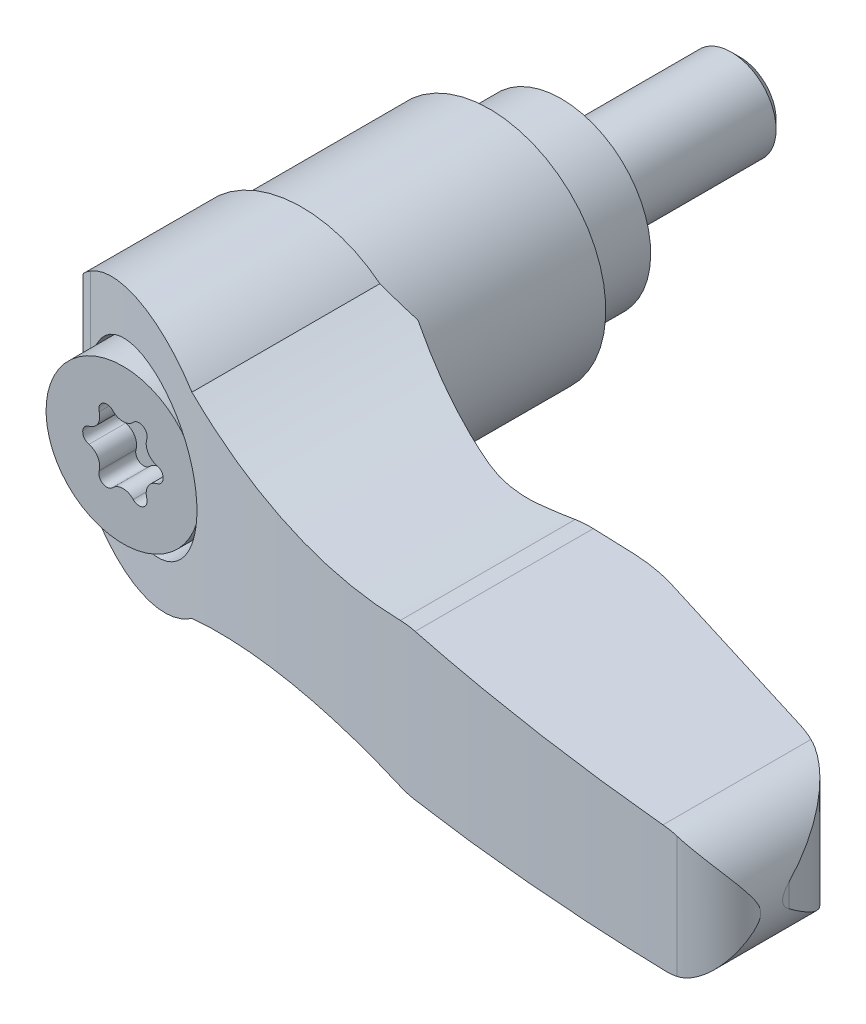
ISO-10303-21;
HEADER;
FILE_DESCRIPTION(('STEP AP214'),'2;1');
FILE_NAME('part.step','',(''),(''),'','','');
FILE_SCHEMA(('AUTOMOTIVE_DESIGN { 1 0 10303 214 1 1 1 1 }'));
ENDSEC;
DATA;
#1=APPLICATION_CONTEXT('core data for automotive mechanical design processes');
#2=APPLICATION_PROTOCOL_DEFINITION('international standard','automotive_design',2000,#1);
#3=PRODUCT_CONTEXT('',#1,'mechanical');
#4=PRODUCT('Part','Part','',(#3));
#5=PRODUCT_RELATED_PRODUCT_CATEGORY('part','',(#4));
#6=PRODUCT_DEFINITION_FORMATION('','',#4);
#7=PRODUCT_DEFINITION_CONTEXT('part definition',#1,'design');
#8=PRODUCT_DEFINITION('design','',#6,#7);
#9=PRODUCT_DEFINITION_SHAPE('','',#8);
#10=(LENGTH_UNIT() NAMED_UNIT(*) SI_UNIT(.MILLI.,.METRE.));
#11=(NAMED_UNIT(*) PLANE_ANGLE_UNIT() SI_UNIT($,.RADIAN.));
#12=(NAMED_UNIT(*) SI_UNIT($,.STERADIAN.) SOLID_ANGLE_UNIT());
#13=UNCERTAINTY_MEASURE_WITH_UNIT(LENGTH_MEASURE(1.E-05),#10,'distance_accuracy_value','');
#14=(GEOMETRIC_REPRESENTATION_CONTEXT(3) GLOBAL_UNCERTAINTY_ASSIGNED_CONTEXT((#13)) GLOBAL_UNIT_ASSIGNED_CONTEXT((#10,
#11,#12)) REPRESENTATION_CONTEXT('',''));
#15=CARTESIAN_POINT('',(0.,0.,0.));
#16=DIRECTION('',(0.,0.,1.));
#17=DIRECTION('',(1.,0.,0.));
#18=AXIS2_PLACEMENT_3D('',#15,#16,#17);
#19=CARTESIAN_POINT('',(1.004266,0.,-10.));
#20=DIRECTION('',(0.,0.,-1.));
#21=DIRECTION('',(0.,1.,0.));
#22=AXIS2_PLACEMENT_3D('',#19,#20,#21);
#23=PLANE('',#22);
#24=CARTESIAN_POINT('',(0.,0.,-10.0000000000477));
#25=DIRECTION('',(0.,0.,1.));
#26=DIRECTION('',(0.,-1.,0.));
#27=AXIS2_PLACEMENT_3D('',#24,#25,#26);
#28=CIRCLE('',#27,2.00853200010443);
#29=CARTESIAN_POINT('',(0.,-2.00853200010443,-10.0000000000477));
#30=VERTEX_POINT('',#29);
#31=EDGE_CURVE('E633',#30,#30,#28,.T.);
#32=ORIENTED_EDGE('',*,*,#31,.F.);
#33=EDGE_LOOP('',(#32));
#34=FACE_BOUND('',#33,.T.);
#35=ADVANCED_FACE('F14',(#34),#23,.T.);
#36=CARTESIAN_POINT('',(0.,0.,-9.50853200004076));
#37=DIRECTION('',(0.,0.,1.));
#38=DIRECTION('',(0.,-1.,0.));
#39=AXIS2_PLACEMENT_3D('',#36,#37,#38);
#40=CONICAL_SURFACE('',#39,2.50000000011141,0.785398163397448);
#41=CARTESIAN_POINT('',(0.,0.,-9.508532));
#42=DIRECTION('',(0.,0.,-1.));
#43=DIRECTION('',(0.,1.,0.));
#44=AXIS2_PLACEMENT_3D('',#41,#42,#43);
#45=CIRCLE('',#44,2.5);
#46=CARTESIAN_POINT('',(0.,2.5,-9.508532));
#47=VERTEX_POINT('',#46);
#48=EDGE_CURVE('E563',#47,#47,#45,.F.);
#49=ORIENTED_EDGE('',*,*,#48,.F.);
#50=EDGE_LOOP('',(#49));
#51=FACE_BOUND('',#50,.T.);
#52=ORIENTED_EDGE('',*,*,#31,.T.);
#53=EDGE_LOOP('',(#52));
#54=FACE_BOUND('',#53,.T.);
#55=ADVANCED_FACE('F786',(#51,#54),#40,.T.);
#56=CARTESIAN_POINT('',(0.,0.,-4.754266));
#57=DIRECTION('',(0.,0.,-1.));
#58=DIRECTION('',(0.,1.,0.));
#59=AXIS2_PLACEMENT_3D('',#56,#57,#58);
#60=CYLINDRICAL_SURFACE('',#59,2.5);
#61=CARTESIAN_POINT('',(0.,0.,0.));
#62=DIRECTION('',(0.,0.,-1.));
#63=DIRECTION('',(0.,1.,0.));
#64=AXIS2_PLACEMENT_3D('',#61,#62,#63);
#65=CIRCLE('',#64,2.5);
#66=CARTESIAN_POINT('',(0.,2.5,0.));
#67=VERTEX_POINT('',#66);
#68=EDGE_CURVE('E559',#67,#67,#65,.F.);
#69=ORIENTED_EDGE('',*,*,#68,.F.);
#70=EDGE_LOOP('',(#69));
#71=FACE_BOUND('',#70,.T.);
#72=ORIENTED_EDGE('',*,*,#48,.T.);
#73=EDGE_LOOP('',(#72));
#74=FACE_BOUND('',#73,.T.);
#75=ADVANCED_FACE('F777',(#71,#74),#60,.T.);
#76=CARTESIAN_POINT('',(3.75,0.,0.));
#77=DIRECTION('',(0.,0.,-1.));
#78=DIRECTION('',(0.,1.,0.));
#79=AXIS2_PLACEMENT_3D('',#76,#77,#78);
#80=PLANE('',#79);
#81=ORIENTED_EDGE('',*,*,#68,.T.);
#82=EDGE_LOOP('',(#81));
#83=FACE_BOUND('',#82,.T.);
#84=CARTESIAN_POINT('',(0.,0.,0.));
#85=DIRECTION('',(0.,0.,-1.));
#86=DIRECTION('',(0.,1.,0.));
#87=AXIS2_PLACEMENT_3D('',#84,#85,#86);
#88=CIRCLE('',#87,5.);
#89=CARTESIAN_POINT('',(0.,5.,0.));
#90=VERTEX_POINT('',#89);
#91=EDGE_CURVE('E652',#90,#90,#88,.F.);
#92=ORIENTED_EDGE('',*,*,#91,.F.);
#93=EDGE_LOOP('',(#92));
#94=FACE_BOUND('',#93,.T.);
#95=ADVANCED_FACE('F769',(#83,#94),#80,.T.);
#96=CARTESIAN_POINT('',(0.,0.,6.4));
#97=DIRECTION('',(0.,0.,-1.));
#98=DIRECTION('',(0.,1.,0.));
#99=AXIS2_PLACEMENT_3D('',#96,#97,#98);
#100=CYLINDRICAL_SURFACE('',#99,5.);
#101=ORIENTED_EDGE('',*,*,#91,.T.);
#102=EDGE_LOOP('',(#101));
#103=FACE_BOUND('',#102,.T.);
#104=CARTESIAN_POINT('',(0.,0.,4.55000000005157));
#105=DIRECTION('',(0.,0.,-1.));
#106=DIRECTION('',(1.,0.,0.));
#107=AXIS2_PLACEMENT_3D('',#104,#105,#106);
#108=CIRCLE('',#107,4.99999999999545);
#109=CARTESIAN_POINT('',(4.99999999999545,0.,4.55000000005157));
#110=VERTEX_POINT('',#109);
#111=EDGE_CURVE('E552',#110,#110,#108,.T.);
#112=ORIENTED_EDGE('',*,*,#111,.T.);
#113=EDGE_LOOP('',(#112));
#114=FACE_BOUND('',#113,.T.);
#115=ADVANCED_FACE('F761',(#103,#114),#100,.T.);
#116=CARTESIAN_POINT('',(0.,0.,4.30000000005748));
#117=DIRECTION('',(0.,0.,-1.));
#118=DIRECTION('',(0.,1.,0.));
#119=AXIS2_PLACEMENT_3D('',#116,#117,#118);
#120=CONICAL_SURFACE('',#119,5.24999999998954,0.785398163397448);
#121=ORIENTED_EDGE('',*,*,#111,.F.);
#122=EDGE_LOOP('',(#121));
#123=FACE_BOUND('',#122,.T.);
#124=CARTESIAN_POINT('',(0.,0.,4.3));
#125=DIRECTION('',(0.,0.,-1.));
#126=DIRECTION('',(0.,1.,0.));
#127=AXIS2_PLACEMENT_3D('',#124,#125,#126);
#128=CIRCLE('',#127,5.25);
#129=CARTESIAN_POINT('',(0.,5.25,4.3));
#130=VERTEX_POINT('',#129);
#131=EDGE_CURVE('E548',#130,#130,#128,.T.);
#132=ORIENTED_EDGE('',*,*,#131,.T.);
#133=EDGE_LOOP('',(#132));
#134=FACE_BOUND('',#133,.T.);
#135=ADVANCED_FACE('F757',(#123,#134),#120,.F.);
#136=CARTESIAN_POINT('',(0.,0.,3.65));
#137=DIRECTION('',(0.,0.,-1.));
#138=DIRECTION('',(0.,1.,0.));
#139=AXIS2_PLACEMENT_3D('',#136,#137,#138);
#140=CYLINDRICAL_SURFACE('',#139,5.25);
#141=ORIENTED_EDGE('',*,*,#131,.F.);
#142=EDGE_LOOP('',(#141));
#143=FACE_BOUND('',#142,.T.);
#144=CARTESIAN_POINT('',(0.,0.,4.));
#145=DIRECTION('',(0.,0.,-1.));
#146=DIRECTION('',(0.,1.,0.));
#147=AXIS2_PLACEMENT_3D('',#144,#145,#146);
#148=CIRCLE('',#147,5.25);
#149=CARTESIAN_POINT('',(0.,5.25,4.));
#150=VERTEX_POINT('',#149);
#151=EDGE_CURVE('E658',#150,#150,#148,.F.);
#152=ORIENTED_EDGE('',*,*,#151,.F.);
#153=EDGE_LOOP('',(#152));
#154=FACE_BOUND('',#153,.T.);
#155=ADVANCED_FACE('F749',(#143,#154),#140,.F.);
#156=CARTESIAN_POINT('',(-6.36002265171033,-14.,4.));
#157=DIRECTION('',(0.707106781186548,0.,0.707106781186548));
#158=DIRECTION('',(-0.707106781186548,0.,0.707106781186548));
#159=AXIS2_PLACEMENT_3D('',#156,#157,#158);
#160=PLANE('',#159);
#161=DIRECTION('',(0.,1.,0.));
#162=VECTOR('',#161,1.);
#163=CARTESIAN_POINT('',(-6.36002265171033,0.,4.));
#164=LINE('',#163,#162);
#165=CARTESIAN_POINT('',(-6.36002265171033,-1.38824072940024,4.));
#166=VERTEX_POINT('',#165);
#167=CARTESIAN_POINT('',(-6.36002265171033,1.38824072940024,4.));
#168=VERTEX_POINT('',#167);
#169=EDGE_CURVE('E661',#166,#168,#164,.T.);
#170=ORIENTED_EDGE('',*,*,#169,.F.);
#171=CARTESIAN_POINT('',(-0.0100000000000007,0.,-2.35002265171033));
#172=DIRECTION('',(0.707106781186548,0.,0.707106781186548));
#173=DIRECTION('',(-0.707106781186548,0.,0.707106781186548));
#174=AXIS2_PLACEMENT_3D('',#171,#172,#173);
#175=ELLIPSE('',#174,9.19238815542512,6.5);
#176=EDGE_CURVE('E551',#168,#166,#175,.T.);
#177=ORIENTED_EDGE('',*,*,#176,.F.);
#178=EDGE_LOOP('',(#170,#177));
#179=FACE_BOUND('',#178,.T.);
#180=ADVANCED_FACE('F744',(#179),#160,.F.);
#181=CARTESIAN_POINT('',(-3.26,0.,4.));
#182=DIRECTION('',(0.,0.,-1.));
#183=DIRECTION('',(0.,1.,0.));
#184=AXIS2_PLACEMENT_3D('',#181,#182,#183);
#185=PLANE('',#184);
#186=CARTESIAN_POINT('',(-0.00999999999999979,0.,4.));
#187=DIRECTION('',(0.,0.,1.));
#188=DIRECTION('',(-1.,0.,0.));
#189=AXIS2_PLACEMENT_3D('',#186,#187,#188);
#190=CIRCLE('',#189,6.5);
#191=EDGE_CURVE('E667',#166,#168,#190,.T.);
#192=ORIENTED_EDGE('',*,*,#191,.F.);
#193=ORIENTED_EDGE('',*,*,#169,.T.);
#194=EDGE_LOOP('',(#192,#193));
#195=FACE_BOUND('',#194,.T.);
#196=ORIENTED_EDGE('',*,*,#151,.T.);
#197=EDGE_LOOP('',(#196));
#198=FACE_BOUND('',#197,.T.);
#199=ADVANCED_FACE('F740',(#195,#198),#185,.T.);
#200=CARTESIAN_POINT('',(39.9389658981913,-8.,27.2042491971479));
#201=DIRECTION('',(0.989626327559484,0.,-0.143665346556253));
#202=DIRECTION('',(0.143665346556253,0.,0.989626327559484));
#203=AXIS2_PLACEMENT_3D('',#200,#201,#202);
#204=PLANE('',#203);
#205=CARTESIAN_POINT('',(36.5,0.,3.51522972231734));
#206=DIRECTION('',(0.989626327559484,0.,-0.143665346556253));
#207=DIRECTION('',(0.143665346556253,0.,0.989626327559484));
#208=AXIS2_PLACEMENT_3D('',#205,#206,#207);
#209=ELLIPSE('',#208,24.3621728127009,3.5);
#210=CARTESIAN_POINT('',(39.9389658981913,-0.650779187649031,27.2042491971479));
#211=VERTEX_POINT('',#210);
#212=CARTESIAN_POINT('',(39.9389658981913,0.650779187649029,27.2042491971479));
#213=VERTEX_POINT('',#212);
#214=EDGE_CURVE('E459',#211,#213,#209,.F.);
#215=ORIENTED_EDGE('',*,*,#214,.F.);
#216=DIRECTION('',(0.,-1.,0.));
#217=VECTOR('',#216,1.);
#218=CARTESIAN_POINT('',(39.9389658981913,-8.,27.2042491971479));
#219=LINE('',#218,#217);
#220=EDGE_CURVE('E666',#213,#211,#219,.T.);
#221=ORIENTED_EDGE('',*,*,#220,.F.);
#222=EDGE_LOOP('',(#215,#221));
#223=FACE_BOUND('',#222,.T.);
#224=ADVANCED_FACE('F483',(#223),#204,.T.);
#225=CARTESIAN_POINT('',(33.8626602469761,-8.,28.0863544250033));
#226=DIRECTION('',(0.,-1.,0.));
#227=DIRECTION('',(1.,0.,0.));
#228=AXIS2_PLACEMENT_3D('',#225,#226,#227);
#229=CYLINDRICAL_SURFACE('',#228,6.14);
#230=ORIENTED_EDGE('',*,*,#220,.T.);
#231=CARTESIAN_POINT('',(36.5,-3.5,22.5416236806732));
#232=CARTESIAN_POINT('',(36.6061539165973,-3.50000941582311,22.5920863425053));
#233=CARTESIAN_POINT('',(36.7107657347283,-3.49517280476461,22.6456099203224));
#234=CARTESIAN_POINT('',(36.9160027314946,-3.47671082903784,22.758101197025));
#235=CARTESIAN_POINT('',(37.0166343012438,-3.46310021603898,22.8170596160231));
#236=CARTESIAN_POINT('',(37.2123479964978,-3.42816986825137,22.9392782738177));
#237=CARTESIAN_POINT('',(37.3074768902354,-3.40693163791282,23.002487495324));
#238=CARTESIAN_POINT('',(37.4929223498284,-3.3575759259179,23.13320682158));
#239=CARTESIAN_POINT('',(37.5832363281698,-3.32945478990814,23.2007191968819));
#240=CARTESIAN_POINT('',(37.7830795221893,-3.25850520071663,23.358740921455));
#241=CARTESIAN_POINT('',(37.8909927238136,-3.21376078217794,23.4504360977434));
#242=CARTESIAN_POINT('',(38.0982482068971,-3.11588681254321,23.6389903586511));
#243=CARTESIAN_POINT('',(38.1975840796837,-3.06275107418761,23.7358532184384));
#244=CARTESIAN_POINT('',(38.3880468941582,-2.94917464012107,23.9343090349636));
#245=CARTESIAN_POINT('',(38.4791322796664,-2.88870020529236,24.0359224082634));
#246=CARTESIAN_POINT('',(38.6526412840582,-2.76182607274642,24.2426721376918));
#247=CARTESIAN_POINT('',(38.7350674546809,-2.69542813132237,24.3478074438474));
#248=CARTESIAN_POINT('',(38.9229341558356,-2.52996933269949,24.6038856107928));
#249=CARTESIAN_POINT('',(39.0243159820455,-2.42850340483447,24.7562617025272));
#250=CARTESIAN_POINT('',(39.2111706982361,-2.21796613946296,25.0654781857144));
#251=CARTESIAN_POINT('',(39.2966363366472,-2.10889136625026,25.2223205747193));
#252=CARTESIAN_POINT('',(39.452222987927,-1.88493092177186,25.5392893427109));
#253=CARTESIAN_POINT('',(39.5223498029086,-1.77004746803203,25.699414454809));
#254=CARTESIAN_POINT('',(39.6478320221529,-1.53583460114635,26.0220530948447));
#255=CARTESIAN_POINT('',(39.7031929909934,-1.41650688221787,26.1845656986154));
#256=CARTESIAN_POINT('',(39.7933776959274,-1.1901857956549,26.4900634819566));
#257=CARTESIAN_POINT('',(39.8299343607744,-1.08360162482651,26.6328455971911));
#258=CARTESIAN_POINT('',(39.8923391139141,-0.86858691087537,26.918504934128));
#259=CARTESIAN_POINT('',(39.918226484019,-0.76016469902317,27.0613798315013));
#260=CARTESIAN_POINT('',(39.9389658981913,-0.650779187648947,27.204249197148));
#261=B_SPLINE_CURVE_WITH_KNOTS('',3,(#231,#232,#233,#234,#235,#236,#237,#238,#239,#240,#241,
#242,#243,#244,#245,#246,#247,#248,#249,#250,#251,#252,#253,#254,#255,#256,#257,#258,#259,#260),
.UNSPECIFIED.,.F.,.F.,(4,2,2,2,2,2,2,2,2,2,2,2,2,2,4),(0.,0.352350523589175,0.704110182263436,
1.05221781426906,1.40051067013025,1.84538152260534,2.29058194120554,2.73791274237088,
3.18511134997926,3.81198117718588,4.43913591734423,5.06605301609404,5.69273352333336,
6.23807905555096,6.78139842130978),.UNSPECIFIED.);
#262=CARTESIAN_POINT('',(36.5,-3.5,22.5416236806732));
#263=VERTEX_POINT('',#262);
#264=EDGE_CURVE('E463',#263,#211,#261,.T.);
#265=ORIENTED_EDGE('',*,*,#264,.F.);
#266=CARTESIAN_POINT('',(33.8626602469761,-3.59762871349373,28.0863544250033));
#267=DIRECTION('',(-0.0369925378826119,0.999315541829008,0.));
#268=DIRECTION('',(-0.999315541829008,-0.0369925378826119,0.));
#269=AXIS2_PLACEMENT_3D('',#266,#267,#268);
#270=ELLIPSE('',#269,6.14420545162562,6.14);
#271=CARTESIAN_POINT('',(35.5344609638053,-3.53574220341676,22.1783359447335));
#272=VERTEX_POINT('',#271);
#273=EDGE_CURVE('E662',#263,#272,#270,.T.);
#274=ORIENTED_EDGE('',*,*,#273,.T.);
#275=DIRECTION('',(0.,-1.,0.));
#276=VECTOR('',#275,1.);
#277=CARTESIAN_POINT('',(35.5344609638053,-8.,22.1783359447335));
#278=LINE('',#277,#276);
#279=CARTESIAN_POINT('',(35.5344609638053,3.53574220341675,22.1783359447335));
#280=VERTEX_POINT('',#279);
#281=EDGE_CURVE('E533',#280,#272,#278,.T.);
#282=ORIENTED_EDGE('',*,*,#281,.F.);
#283=CARTESIAN_POINT('',(33.8626602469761,3.59762871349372,28.0863544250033));
#284=DIRECTION('',(-0.036992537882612,-0.999315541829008,0.));
#285=DIRECTION('',(0.999315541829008,-0.036992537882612,0.));
#286=AXIS2_PLACEMENT_3D('',#283,#284,#285);
#287=ELLIPSE('',#286,6.14420545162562,6.14);
#288=CARTESIAN_POINT('',(36.5,3.5,22.5416236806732));
#289=VERTEX_POINT('',#288);
#290=EDGE_CURVE('E664',#280,#289,#287,.T.);
#291=ORIENTED_EDGE('',*,*,#290,.T.);
#292=CARTESIAN_POINT('',(39.9389658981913,0.65077918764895,27.204249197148));
#293=CARTESIAN_POINT('',(39.9247028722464,0.726086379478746,27.1059853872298));
#294=CARTESIAN_POINT('',(39.9079968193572,0.800887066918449,27.0076860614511));
#295=CARTESIAN_POINT('',(39.8696347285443,0.949458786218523,26.8112602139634));
#296=CARTESIAN_POINT('',(39.8479781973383,1.02322971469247,26.7131337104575));
#297=CARTESIAN_POINT('',(39.7995979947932,1.169880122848,26.5170899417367));
#298=CARTESIAN_POINT('',(39.7728626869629,1.24275713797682,26.4191736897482));
#299=CARTESIAN_POINT('',(39.7142815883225,1.38725410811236,26.2239599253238));
#300=CARTESIAN_POINT('',(39.6824358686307,1.4588740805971,26.1266624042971));
#301=CARTESIAN_POINT('',(39.5782917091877,1.67318502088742,25.8337016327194));
#302=CARTESIAN_POINT('',(39.4979263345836,1.81366367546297,25.6391889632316));
#303=CARTESIAN_POINT('',(39.3150854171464,2.08619457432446,25.2551202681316));
#304=CARTESIAN_POINT('',(39.2126344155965,2.218255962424,25.0655590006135));
#305=CARTESIAN_POINT('',(38.9595027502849,2.49877334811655,24.6523338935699));
#306=CARTESIAN_POINT('',(38.8031801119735,2.64456339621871,24.4302018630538));
#307=CARTESIAN_POINT('',(38.5417124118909,2.84488994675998,24.1082756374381));
#308=CARTESIAN_POINT('',(38.4501831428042,2.90854134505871,24.0029632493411));
#309=CARTESIAN_POINT('',(38.2579442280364,3.02861213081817,23.7967186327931));
#310=CARTESIAN_POINT('',(38.1572360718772,3.08503268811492,23.6957856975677));
#311=CARTESIAN_POINT('',(37.8892625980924,3.21757634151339,23.4457323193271));
#312=CARTESIAN_POINT('',(37.7155213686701,3.28779061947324,23.3001643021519));
#313=CARTESIAN_POINT('',(37.4396992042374,3.37286339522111,23.0946053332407));
#314=CARTESIAN_POINT('',(37.3453175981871,3.39783246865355,23.0282732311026));
#315=CARTESIAN_POINT('',(37.1517842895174,3.44019984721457,22.9003457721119));
#316=CARTESIAN_POINT('',(37.0526354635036,3.45760265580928,22.8387476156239));
#317=CARTESIAN_POINT('',(36.8781783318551,3.48029211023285,22.7372021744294));
#318=CARTESIAN_POINT('',(36.8038676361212,3.48759914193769,22.6959814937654));
#319=CARTESIAN_POINT('',(36.6533047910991,3.497455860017,22.6165121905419));
#320=CARTESIAN_POINT('',(36.5770513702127,3.50000234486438,22.5782655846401));
#321=CARTESIAN_POINT('',(36.5,3.5,22.5416236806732));
#322=B_SPLINE_CURVE_WITH_KNOTS('',3,(#292,#293,#294,#295,#296,#297,#298,#299,#300,#301,#302,
#303,#304,#305,#306,#307,#308,#309,#310,#311,#312,#313,#314,#315,#316,#317,#318,#319,#320,#321),
.UNSPECIFIED.,.F.,.F.,(4,2,2,2,2,2,2,2,2,2,2,2,2,2,4),(0.,0.373839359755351,0.747715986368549,
1.12245980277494,1.49719840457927,2.25512351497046,3.01221072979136,3.93367725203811,
4.39332639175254,4.85290107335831,5.56171222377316,5.91546495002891,6.26900683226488,
6.52468766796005,6.78054039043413),.UNSPECIFIED.);
#323=EDGE_CURVE('E432',#213,#289,#322,.T.);
#324=ORIENTED_EDGE('',*,*,#323,.F.);
#325=EDGE_LOOP('',(#230,#265,#274,#282,#291,#324));
#326=FACE_BOUND('',#325,.T.);
#327=ADVANCED_FACE('F477',(#326),#229,.T.);
#328=CARTESIAN_POINT('',(-0.0099999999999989,0.,10.28125));
#329=DIRECTION('',(0.,0.,1.));
#330=DIRECTION('',(-1.,0.,0.));
#331=AXIS2_PLACEMENT_3D('',#328,#329,#330);
#332=CYLINDRICAL_SURFACE('',#331,6.5);
#333=CARTESIAN_POINT('',(-0.00999999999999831,0.,14.5));
#334=DIRECTION('',(0.,0.,1.));
#335=DIRECTION('',(-1.,0.,0.));
#336=AXIS2_PLACEMENT_3D('',#333,#334,#335);
#337=CIRCLE('',#336,6.5);
#338=CARTESIAN_POINT('',(-6.51,0.,14.5));
#339=VERTEX_POINT('',#338);
#340=CARTESIAN_POINT('',(6.49,0.,14.5));
#341=VERTEX_POINT('',#340);
#342=EDGE_CURVE('E669',#339,#341,#337,.T.);
#343=ORIENTED_EDGE('',*,*,#342,.F.);
#344=CARTESIAN_POINT('',(-0.00999999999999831,0.,14.5));
#345=DIRECTION('',(0.,0.,1.));
#346=DIRECTION('',(-1.,0.,0.));
#347=AXIS2_PLACEMENT_3D('',#344,#345,#346);
#348=CIRCLE('',#347,6.5);
#349=EDGE_CURVE('E530',#341,#339,#348,.T.);
#350=ORIENTED_EDGE('',*,*,#349,.F.);
#351=EDGE_LOOP('',(#343,#350));
#352=FACE_BOUND('',#351,.T.);
#353=ORIENTED_EDGE('',*,*,#191,.T.);
#354=ORIENTED_EDGE('',*,*,#176,.T.);
#355=EDGE_LOOP('',(#353,#354));
#356=FACE_BOUND('',#355,.T.);
#357=ADVANCED_FACE('F482',(#352,#356),#332,.T.);
#358=CARTESIAN_POINT('',(-6.51,-8.,14.5));
#359=DIRECTION('',(0.,0.,-1.));
#360=DIRECTION('',(0.,1.,0.));
#361=AXIS2_PLACEMENT_3D('',#358,#359,#360);
#362=PLANE('',#361);
#363=ORIENTED_EDGE('',*,*,#342,.T.);
#364=DIRECTION('',(0.,-1.,0.));
#365=VECTOR('',#364,1.);
#366=CARTESIAN_POINT('',(6.49,-8.,14.5));
#367=LINE('',#366,#365);
#368=CARTESIAN_POINT('',(6.49,-4.77390244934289,14.5));
#369=VERTEX_POINT('',#368);
#370=EDGE_CURVE('E1148',#341,#369,#367,.T.);
#371=ORIENTED_EDGE('',*,*,#370,.T.);
#372=CARTESIAN_POINT('',(14.8,-33.6,14.5));
#373=DIRECTION('',(0.,0.,1.));
#374=DIRECTION('',(0.,-1.,0.));
#375=AXIS2_PLACEMENT_3D('',#372,#373,#374);
#376=CIRCLE('',#375,30.);
#377=CARTESIAN_POINT('',(4.36278582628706,-5.47413005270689,14.5));
#378=VERTEX_POINT('',#377);
#379=EDGE_CURVE('E706',#369,#378,#376,.T.);
#380=ORIENTED_EDGE('',*,*,#379,.T.);
#381=CARTESIAN_POINT('',(0.,0.,14.5));
#382=DIRECTION('',(0.,0.,1.));
#383=DIRECTION('',(0.,-1.,0.));
#384=AXIS2_PLACEMENT_3D('',#381,#382,#383);
#385=CIRCLE('',#384,7.);
#386=CARTESIAN_POINT('',(-6.51,-2.57291663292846,14.5));
#387=VERTEX_POINT('',#386);
#388=EDGE_CURVE('E370',#387,#378,#385,.T.);
#389=ORIENTED_EDGE('',*,*,#388,.F.);
#390=DIRECTION('',(0.,-1.,0.));
#391=VECTOR('',#390,1.);
#392=CARTESIAN_POINT('',(-6.51,-8.,14.5));
#393=LINE('',#392,#391);
#394=EDGE_CURVE('E529',#339,#387,#393,.T.);
#395=ORIENTED_EDGE('',*,*,#394,.F.);
#396=EDGE_LOOP('',(#363,#371,#380,#389,#395));
#397=FACE_BOUND('',#396,.T.);
#398=ADVANCED_FACE('F488',(#397),#362,.T.);
#399=CARTESIAN_POINT('',(20.6060580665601,0.915064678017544,31.));
#400=DIRECTION('',(0.,0.,1.));
#401=DIRECTION('',(0.,-1.,0.));
#402=AXIS2_PLACEMENT_3D('',#399,#400,#401);
#403=CYLINDRICAL_SURFACE('',#402,5.);
#404=CARTESIAN_POINT('',(20.7910207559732,-4.08151303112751,28.9575923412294));
#405=CARTESIAN_POINT('',(20.6207575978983,-4.08776311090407,28.9275070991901));
#406=CARTESIAN_POINT('',(20.4510927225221,-4.08540030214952,28.8972050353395));
#407=CARTESIAN_POINT('',(20.1129595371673,-4.06344890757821,28.8361672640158));
#408=CARTESIAN_POINT('',(19.9444912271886,-4.04386032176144,28.8054315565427));
#409=CARTESIAN_POINT('',(19.7766211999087,-4.01565884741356,28.7744790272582));
#410=B_SPLINE_CURVE_WITH_KNOTS('',3,(#404,#405,#406,#407,#408,#409),.UNSPECIFIED.,.F.,.F.,(4,2,
4),(0.,0.517097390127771,1.03419478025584),.UNSPECIFIED.);
#411=CARTESIAN_POINT('',(20.7910207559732,-4.08151303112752,28.9575923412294));
#412=VERTEX_POINT('',#411);
#413=CARTESIAN_POINT('',(19.7766211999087,-4.01565884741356,28.7744790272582));
#414=VERTEX_POINT('',#413);
#415=EDGE_CURVE('E466',#412,#414,#410,.T.);
#416=ORIENTED_EDGE('',*,*,#415,.T.);
#417=DIRECTION('',(0.,0.,1.));
#418=VECTOR('',#417,1.);
#419=CARTESIAN_POINT('',(19.7766211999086,-4.01565884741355,31.));
#420=LINE('',#419,#418);
#421=CARTESIAN_POINT('',(19.7766211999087,-4.01565884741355,19.));
#422=VERTEX_POINT('',#421);
#423=EDGE_CURVE('E674',#414,#422,#420,.F.);
#424=ORIENTED_EDGE('',*,*,#423,.T.);
#425=CARTESIAN_POINT('',(20.6060580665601,0.915064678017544,19.));
#426=DIRECTION('',(0.,0.,1.));
#427=DIRECTION('',(0.,-1.,0.));
#428=AXIS2_PLACEMENT_3D('',#425,#426,#427);
#429=CIRCLE('',#428,5.);
#430=CARTESIAN_POINT('',(20.7910207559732,-4.08151303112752,19.));
#431=VERTEX_POINT('',#430);
#432=EDGE_CURVE('E1141',#431,#422,#429,.F.);
#433=ORIENTED_EDGE('',*,*,#432,.F.);
#434=DIRECTION('',(0.,0.,1.));
#435=VECTOR('',#434,1.);
#436=CARTESIAN_POINT('',(20.7910207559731,-4.08151303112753,31.));
#437=LINE('',#436,#435);
#438=EDGE_CURVE('E677',#431,#412,#437,.T.);
#439=ORIENTED_EDGE('',*,*,#438,.T.);
#440=EDGE_LOOP('',(#416,#424,#433,#439));
#441=FACE_BOUND('',#440,.T.);
#442=ADVANCED_FACE('F424',(#441),#403,.T.);
#443=CARTESIAN_POINT('',(36.5,0.,31.));
#444=DIRECTION('',(0.,0.,1.));
#445=DIRECTION('',(0.,-1.,0.));
#446=AXIS2_PLACEMENT_3D('',#443,#444,#445);
#447=CYLINDRICAL_SURFACE('',#446,3.5);
#448=CARTESIAN_POINT('',(37.3240183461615,-3.40161634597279,30.8631619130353));
#449=CARTESIAN_POINT('',(37.188603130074,-3.43435641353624,30.8557619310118));
#450=CARTESIAN_POINT('',(37.0522273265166,-3.45892508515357,30.8481012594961));
#451=CARTESIAN_POINT('',(36.7775545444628,-3.49171963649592,30.8322585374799));
#452=CARTESIAN_POINT('',(36.6392575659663,-3.499945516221,30.8240764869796));
#453=CARTESIAN_POINT('',(36.5,-3.5,30.815633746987));
#454=B_SPLINE_CURVE_WITH_KNOTS('',3,(#448,#449,#450,#451,#452,#453),.UNSPECIFIED.,.F.,.F.,(4,2,
4),(0.,0.416348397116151,0.832696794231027),.UNSPECIFIED.);
#455=CARTESIAN_POINT('',(37.3240183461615,-3.40161634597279,30.8631619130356));
#456=VERTEX_POINT('',#455);
#457=CARTESIAN_POINT('',(36.5,-3.5,30.815633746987));
#458=VERTEX_POINT('',#457);
#459=EDGE_CURVE('E444',#456,#458,#454,.T.);
#460=ORIENTED_EDGE('',*,*,#459,.T.);
#461=DIRECTION('',(0.,0.,1.));
#462=VECTOR('',#461,1.);
#463=CARTESIAN_POINT('',(36.5,-3.5,31.));
#464=LINE('',#463,#462);
#465=EDGE_CURVE('E712',#458,#263,#464,.F.);
#466=ORIENTED_EDGE('',*,*,#465,.T.);
#467=ORIENTED_EDGE('',*,*,#264,.T.);
#468=ORIENTED_EDGE('',*,*,#214,.T.);
#469=ORIENTED_EDGE('',*,*,#323,.T.);
#470=DIRECTION('',(0.,0.,1.));
#471=VECTOR('',#470,1.);
#472=CARTESIAN_POINT('',(36.5,3.5,31.));
#473=LINE('',#472,#471);
#474=CARTESIAN_POINT('',(36.5,3.5,30.815633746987));
#475=VERTEX_POINT('',#474);
#476=EDGE_CURVE('E412',#289,#475,#473,.T.);
#477=ORIENTED_EDGE('',*,*,#476,.T.);
#478=CARTESIAN_POINT('',(36.5,3.5,30.815633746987));
#479=CARTESIAN_POINT('',(36.6392575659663,3.499945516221,30.8240764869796));
#480=CARTESIAN_POINT('',(36.7775545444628,3.49171963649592,30.8322585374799));
#481=CARTESIAN_POINT('',(37.0522273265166,3.45892508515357,30.8481012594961));
#482=CARTESIAN_POINT('',(37.188603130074,3.43435641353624,30.8557619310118));
#483=CARTESIAN_POINT('',(37.3240183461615,3.40161634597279,30.8631619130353));
#484=B_SPLINE_CURVE_WITH_KNOTS('',3,(#478,#479,#480,#481,#482,#483),.UNSPECIFIED.,.F.,.F.,(4,2,
4),(0.,0.416348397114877,0.832696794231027),.UNSPECIFIED.);
#485=CARTESIAN_POINT('',(37.3240183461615,3.40161634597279,30.8631619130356));
#486=VERTEX_POINT('',#485);
#487=EDGE_CURVE('E450',#475,#486,#484,.T.);
#488=ORIENTED_EDGE('',*,*,#487,.T.);
#489=CARTESIAN_POINT('',(37.3240183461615,-3.40161634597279,30.8631619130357));
#490=CARTESIAN_POINT('',(37.391971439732,-3.38517327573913,30.8668921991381));
#491=CARTESIAN_POINT('',(37.4595366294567,-3.36663320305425,30.8678982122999));
#492=CARTESIAN_POINT('',(37.5932555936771,-3.32560440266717,30.8647814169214));
#493=CARTESIAN_POINT('',(37.6594109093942,-3.30312026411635,30.8606645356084));
#494=CARTESIAN_POINT('',(37.7892420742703,-3.25463078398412,30.8476880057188));
#495=CARTESIAN_POINT('',(37.8529349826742,-3.22865926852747,30.8388717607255));
#496=CARTESIAN_POINT('',(37.9780608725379,-3.17332967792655,30.8169101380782));
#497=CARTESIAN_POINT('',(38.0394932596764,-3.14397072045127,30.8037636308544));
#498=CARTESIAN_POINT('',(38.2193405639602,-3.05154774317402,30.7585650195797));
#499=CARTESIAN_POINT('',(38.3339861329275,-2.98387991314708,30.7206782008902));
#500=CARTESIAN_POINT('',(38.5517467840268,-2.83858348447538,30.6324207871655));
#501=CARTESIAN_POINT('',(38.6548343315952,-2.76093200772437,30.5820212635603));
#502=CARTESIAN_POINT('',(38.8266237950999,-2.61655584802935,30.4842690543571));
#503=CARTESIAN_POINT('',(38.8977926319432,-2.55140368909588,30.4388637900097));
#504=CARTESIAN_POINT('',(39.0330318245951,-2.41719472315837,30.3433991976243));
#505=CARTESIAN_POINT('',(39.0970985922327,-2.34813596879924,30.2933375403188));
#506=CARTESIAN_POINT('',(39.2184581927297,-2.20651617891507,30.1893556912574));
#507=CARTESIAN_POINT('',(39.2757265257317,-2.13394372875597,30.1354226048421));
#508=CARTESIAN_POINT('',(39.3834200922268,-1.9860149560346,30.0247265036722));
#509=CARTESIAN_POINT('',(39.4338475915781,-1.91065956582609,29.9679644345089));
#510=CARTESIAN_POINT('',(39.542421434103,-1.73419420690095,29.8348143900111));
#511=CARTESIAN_POINT('',(39.598263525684,-1.63221056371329,29.7576996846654));
#512=CARTESIAN_POINT('',(39.699250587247,-1.42414609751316,29.601672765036));
#513=CARTESIAN_POINT('',(39.7443776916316,-1.31805876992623,29.5227577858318));
#514=CARTESIAN_POINT('',(39.8239747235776,-1.10201279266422,29.3659397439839));
#515=CARTESIAN_POINT('',(39.8584944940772,-0.992075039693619,29.2880336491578));
#516=CARTESIAN_POINT('',(39.9024720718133,-0.82253324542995,29.1754655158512));
#517=CARTESIAN_POINT('',(39.9158188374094,-0.765322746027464,29.13870216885));
#518=CARTESIAN_POINT('',(39.9398686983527,-0.648731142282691,29.0678855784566));
#519=CARTESIAN_POINT('',(39.9505741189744,-0.589352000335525,29.0338299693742));
#520=CARTESIAN_POINT('',(39.9677206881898,-0.477086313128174,28.9756719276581));
#521=CARTESIAN_POINT('',(39.974567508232,-0.424644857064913,28.9508463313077));
#522=CARTESIAN_POINT('',(39.9860225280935,-0.317100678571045,28.907341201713));
#523=CARTESIAN_POINT('',(39.9906385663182,-0.262008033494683,28.8886402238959));
#524=CARTESIAN_POINT('',(39.9966232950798,-0.160247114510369,28.8637621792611));
#525=CARTESIAN_POINT('',(39.9984523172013,-0.114054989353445,28.8558445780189));
#526=CARTESIAN_POINT('',(40.0002450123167,-0.0209847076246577,28.8480882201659));
#527=CARTESIAN_POINT('',(40.0002117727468,0.0258921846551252,28.8482360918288));
#528=CARTESIAN_POINT('',(39.9982952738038,0.118672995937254,28.8565205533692));
#529=CARTESIAN_POINT('',(39.9964185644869,0.164579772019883,28.8646288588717));
#530=CARTESIAN_POINT('',(39.9910078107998,0.254792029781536,28.8870889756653));
#531=CARTESIAN_POINT('',(39.9874686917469,0.299092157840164,28.9014598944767));
#532=CARTESIAN_POINT('',(39.9768286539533,0.407331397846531,28.9425912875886));
#533=CARTESIAN_POINT('',(39.9688318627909,0.470155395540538,28.9719647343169));
#534=CARTESIAN_POINT('',(39.9499914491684,0.592804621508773,29.0357410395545));
#535=CARTESIAN_POINT('',(39.9391403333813,0.652621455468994,29.0701570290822));
#536=CARTESIAN_POINT('',(39.9146680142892,0.770512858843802,29.1419527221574));
#537=CARTESIAN_POINT('',(39.9010255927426,0.828569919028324,29.1793537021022));
#538=CARTESIAN_POINT('',(39.8711029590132,0.942947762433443,29.2555520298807));
#539=CARTESIAN_POINT('',(39.8548256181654,0.999270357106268,29.2943478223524));
#540=CARTESIAN_POINT('',(39.8016739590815,1.1674299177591,29.4125134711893));
#541=CARTESIAN_POINT('',(39.7607265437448,1.27728939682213,29.4929030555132));
#542=CARTESIAN_POINT('',(39.6677865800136,1.49294867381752,29.6529500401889));
#543=CARTESIAN_POINT('',(39.6157834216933,1.59874445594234,29.7326066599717));
#544=CARTESIAN_POINT('',(39.5005966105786,1.80564912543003,29.8886982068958));
#545=CARTESIAN_POINT('',(39.4374685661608,1.90677830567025,29.9651469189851));
#546=CARTESIAN_POINT('',(39.2994325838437,2.10420227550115,30.1133265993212));
#547=CARTESIAN_POINT('',(39.2245348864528,2.20050117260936,30.1850615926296));
#548=CARTESIAN_POINT('',(39.0442952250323,2.40820732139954,30.3372677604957));
#549=CARTESIAN_POINT('',(38.9358891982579,2.51819093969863,30.4161164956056));
#550=CARTESIAN_POINT('',(38.7000552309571,2.72661786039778,30.559662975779));
#551=CARTESIAN_POINT('',(38.5726400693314,2.82506883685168,30.6243701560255));
#552=CARTESIAN_POINT('',(38.3254291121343,2.98922527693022,30.7237895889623));
#553=CARTESIAN_POINT('',(38.2087731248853,3.05759969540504,30.7618633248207));
#554=CARTESIAN_POINT('',(37.9650872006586,3.18151973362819,30.8217517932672));
#555=CARTESIAN_POINT('',(37.8380870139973,3.23710049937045,30.8436114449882));
#556=CARTESIAN_POINT('',(37.6449762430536,3.3080955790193,30.8616374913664));
#557=CARTESIAN_POINT('',(37.5816159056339,3.32934954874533,30.8652564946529));
#558=CARTESIAN_POINT('',(37.4536360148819,3.36824327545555,30.867801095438));
#559=CARTESIAN_POINT('',(37.389015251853,3.38587935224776,30.8667219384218));
#560=CARTESIAN_POINT('',(37.3240183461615,3.40161634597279,30.8631619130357));
#561=B_SPLINE_CURVE_WITH_KNOTS('',3,(#489,#490,#491,#492,#493,#494,#495,#496,#497,#498,#499,
#500,#501,#502,#503,#504,#505,#506,#507,#508,#509,#510,#511,#512,#513,#514,#515,#516,#517,#518,
#519,#520,#521,#522,#523,#524,#525,#526,#527,#528,#529,#530,#531,#532,#533,#534,#535,#536,#537,
#538,#539,#540,#541,#542,#543,#544,#545,#546,#547,#548,#549,#550,#551,#552,#553,#554,#555,#556,
#557,#558,#559,#560),.UNSPECIFIED.,.F.,.F.,(4,2,2,2,2,2,2,2,2,2,2,2,2,2,2,2,2,2,2,2,2,2,2,2,2,2,
2,2,2,2,2,2,2,2,2,4),(0.,0.20991378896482,0.419584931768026,0.62735226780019,0.83517384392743,
1.2486492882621,1.66308971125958,1.98257890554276,2.30222878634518,2.62299771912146,
2.94366014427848,3.36167065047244,3.78037330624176,4.19707731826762,4.40489951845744,
4.61253810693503,4.78756393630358,4.9619702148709,5.10204921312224,5.24189598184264,
5.38124764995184,5.52102749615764,5.72989301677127,5.9393124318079,6.15038720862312,
6.36123350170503,6.7871576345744,7.21349237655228,7.63775356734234,8.06164764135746,
8.58013018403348,9.09826573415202,9.51811060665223,9.9367879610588,10.1373304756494,
10.3380759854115),.UNSPECIFIED.);
#562=EDGE_CURVE('E404',#456,#486,#561,.T.);
#563=ORIENTED_EDGE('',*,*,#562,.F.);
#564=EDGE_LOOP('',(#460,#466,#467,#468,#469,#477,#488,#563));
#565=FACE_BOUND('',#564,.T.);
#566=ADVANCED_FACE('F418',(#565),#447,.T.);
#567=CARTESIAN_POINT('',(23.0466685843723,-8.,28.05));
#568=DIRECTION('',(0.,-1.,0.));
#569=DIRECTION('',(1.,0.,0.));
#570=AXIS2_PLACEMENT_3D('',#567,#568,#569);
#571=CYLINDRICAL_SURFACE('',#570,9.05000000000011);
#572=CARTESIAN_POINT('',(23.0466685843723,3.99801374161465,28.05));
#573=DIRECTION('',(-0.036992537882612,-0.999315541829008,0.));
#574=DIRECTION('',(0.999315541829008,-0.036992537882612,0.));
#575=AXIS2_PLACEMENT_3D('',#572,#573,#574);
#576=ELLIPSE('',#575,9.05619858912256,9.05000000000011);
#577=CARTESIAN_POINT('',(23.0466685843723,3.99801374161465,19.));
#578=VERTEX_POINT('',#577);
#579=CARTESIAN_POINT('',(25.5108048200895,3.90679665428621,19.34192715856));
#580=VERTEX_POINT('',#579);
#581=EDGE_CURVE('E400',#578,#580,#576,.T.);
#582=ORIENTED_EDGE('',*,*,#581,.T.);
#583=DIRECTION('',(0.,-1.,0.));
#584=VECTOR('',#583,1.);
#585=CARTESIAN_POINT('',(25.5108048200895,-8.,19.34192715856));
#586=LINE('',#585,#584);
#587=CARTESIAN_POINT('',(25.5108048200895,-3.90679665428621,19.34192715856));
#588=VERTEX_POINT('',#587);
#589=EDGE_CURVE('E457',#588,#580,#586,.F.);
#590=ORIENTED_EDGE('',*,*,#589,.F.);
#591=CARTESIAN_POINT('',(23.0466685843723,-3.99801374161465,28.05));
#592=DIRECTION('',(-0.0369925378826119,0.999315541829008,0.));
#593=DIRECTION('',(-0.999315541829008,-0.0369925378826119,0.));
#594=AXIS2_PLACEMENT_3D('',#591,#592,#593);
#595=ELLIPSE('',#594,9.05619858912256,9.05000000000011);
#596=CARTESIAN_POINT('',(23.0466685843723,-3.99801374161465,19.));
#597=VERTEX_POINT('',#596);
#598=EDGE_CURVE('E414',#588,#597,#595,.T.);
#599=ORIENTED_EDGE('',*,*,#598,.T.);
#600=DIRECTION('',(0.,1.,0.));
#601=VECTOR('',#600,1.);
#602=CARTESIAN_POINT('',(23.0466685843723,-8.,19.));
#603=LINE('',#602,#601);
#604=EDGE_CURVE('E537',#578,#597,#603,.F.);
#605=ORIENTED_EDGE('',*,*,#604,.F.);
#606=EDGE_LOOP('',(#582,#590,#599,#605));
#607=FACE_BOUND('',#606,.T.);
#608=ADVANCED_FACE('F423',(#607),#571,.T.);
#609=CARTESIAN_POINT('',(25.5108048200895,-8.,19.34192715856));
#610=DIRECTION('',(0.272280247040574,0.,-0.962217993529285));
#611=DIRECTION('',(0.962217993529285,0.,0.272280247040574));
#612=AXIS2_PLACEMENT_3D('',#609,#610,#611);
#613=PLANE('',#612);
#614=DIRECTION('',(0.961608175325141,-0.0355966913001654,0.272107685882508));
#615=VECTOR('',#614,1.);
#616=CARTESIAN_POINT('',(25.5108048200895,3.90679665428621,19.34192715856));
#617=LINE('',#616,#615);
#618=EDGE_CURVE('E402',#580,#280,#617,.T.);
#619=ORIENTED_EDGE('',*,*,#618,.T.);
#620=ORIENTED_EDGE('',*,*,#281,.T.);
#621=DIRECTION('',(-0.961608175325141,-0.0355966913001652,-0.272107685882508));
#622=VECTOR('',#621,1.);
#623=CARTESIAN_POINT('',(35.5344609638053,-3.53574220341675,22.1783359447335));
#624=LINE('',#623,#622);
#625=EDGE_CURVE('E709',#272,#588,#624,.T.);
#626=ORIENTED_EDGE('',*,*,#625,.T.);
#627=ORIENTED_EDGE('',*,*,#589,.T.);
#628=EDGE_LOOP('',(#619,#620,#626,#627));
#629=FACE_BOUND('',#628,.T.);
#630=ADVANCED_FACE('F1010',(#629),#613,.T.);
#631=CARTESIAN_POINT('',(20.60605806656,-0.915064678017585,31.));
#632=DIRECTION('',(0.,0.,1.));
#633=DIRECTION('',(0.,-1.,0.));
#634=AXIS2_PLACEMENT_3D('',#631,#632,#633);
#635=CYLINDRICAL_SURFACE('',#634,5.00000000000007);
#636=CARTESIAN_POINT('',(19.7766211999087,4.01565884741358,28.7744790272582));
#637=CARTESIAN_POINT('',(19.9444912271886,4.04386032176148,28.8054315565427));
#638=CARTESIAN_POINT('',(20.1129595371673,4.06344890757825,28.8361672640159));
#639=CARTESIAN_POINT('',(20.4510927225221,4.08540030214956,28.8972050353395));
#640=CARTESIAN_POINT('',(20.6207575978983,4.08776311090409,28.9275070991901));
#641=CARTESIAN_POINT('',(20.7910207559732,4.08151303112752,28.9575923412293));
#642=B_SPLINE_CURVE_WITH_KNOTS('',3,(#636,#637,#638,#639,#640,#641),.UNSPECIFIED.,.F.,.F.,(4,2,
4),(0.,0.517097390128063,1.03419478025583),.UNSPECIFIED.);
#643=CARTESIAN_POINT('',(19.7766211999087,4.01565884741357,28.7744790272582));
#644=VERTEX_POINT('',#643);
#645=CARTESIAN_POINT('',(20.7910207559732,4.08151303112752,28.9575923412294));
#646=VERTEX_POINT('',#645);
#647=EDGE_CURVE('E536',#644,#646,#642,.T.);
#648=ORIENTED_EDGE('',*,*,#647,.T.);
#649=DIRECTION('',(0.,0.,1.));
#650=VECTOR('',#649,1.);
#651=CARTESIAN_POINT('',(20.7910207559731,4.08151303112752,31.));
#652=LINE('',#651,#650);
#653=CARTESIAN_POINT('',(20.7910207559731,4.08151303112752,19.));
#654=VERTEX_POINT('',#653);
#655=EDGE_CURVE('E720',#646,#654,#652,.F.);
#656=ORIENTED_EDGE('',*,*,#655,.T.);
#657=CARTESIAN_POINT('',(20.60605806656,-0.915064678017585,19.));
#658=DIRECTION('',(0.,0.,1.));
#659=DIRECTION('',(0.,-1.,0.));
#660=AXIS2_PLACEMENT_3D('',#657,#658,#659);
#661=CIRCLE('',#660,5.00000000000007);
#662=CARTESIAN_POINT('',(19.7766211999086,4.01565884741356,19.));
#663=VERTEX_POINT('',#662);
#664=EDGE_CURVE('E541',#663,#654,#661,.F.);
#665=ORIENTED_EDGE('',*,*,#664,.F.);
#666=DIRECTION('',(0.,0.,1.));
#667=VECTOR('',#666,1.);
#668=CARTESIAN_POINT('',(19.7766211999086,4.01565884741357,31.));
#669=LINE('',#668,#667);
#670=EDGE_CURVE('E399',#663,#644,#669,.T.);
#671=ORIENTED_EDGE('',*,*,#670,.T.);
#672=EDGE_LOOP('',(#648,#656,#665,#671));
#673=FACE_BOUND('',#672,.T.);
#674=ADVANCED_FACE('F1002',(#673),#635,.T.);
#675=CARTESIAN_POINT('',(42.8289340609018,-8.,-49.9630271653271));
#676=DIRECTION('',(0.,-1.,0.));
#677=DIRECTION('',(1.,0.,0.));
#678=AXIS2_PLACEMENT_3D('',#675,#676,#677);
#679=CYLINDRICAL_SURFACE('',#678,74.0000000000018);
#680=DIRECTION('',(0.,-1.,0.));
#681=VECTOR('',#680,1.);
#682=CARTESIAN_POINT('',(14.2560355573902,-8.,18.2981585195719));
#683=LINE('',#682,#681);
#684=CARTESIAN_POINT('',(14.2560355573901,3.60493202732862,18.2981585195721));
#685=VERTEX_POINT('',#684);
#686=CARTESIAN_POINT('',(14.2560355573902,-3.60493202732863,18.2981585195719));
#687=VERTEX_POINT('',#686);
#688=EDGE_CURVE('E1143',#685,#687,#683,.T.);
#689=ORIENTED_EDGE('',*,*,#688,.T.);
#690=CARTESIAN_POINT('',(14.2560355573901,-3.60493202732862,18.2981585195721));
#691=CARTESIAN_POINT('',(13.91912090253,-3.61104217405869,18.1571345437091));
#692=CARTESIAN_POINT('',(13.5833701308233,-3.62280963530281,18.0136612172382));
#693=CARTESIAN_POINT('',(12.9145226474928,-3.65743626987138,17.7219861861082));
#694=CARTESIAN_POINT('',(12.5814258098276,-3.68029491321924,17.5737847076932));
#695=CARTESIAN_POINT('',(11.5893580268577,-3.7649360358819,17.1235938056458));
#696=CARTESIAN_POINT('',(10.9347595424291,-3.84283944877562,16.8148240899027));
#697=CARTESIAN_POINT('',(9.64003521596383,-4.03983028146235,16.1808788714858));
#698=CARTESIAN_POINT('',(8.99990836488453,-4.15891482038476,15.8557045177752));
#699=CARTESIAN_POINT('',(7.73340291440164,-4.43691869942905,15.1892512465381));
#700=CARTESIAN_POINT('',(7.10709183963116,-4.5960001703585,14.8479114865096));
#701=CARTESIAN_POINT('',(6.49,-4.77390244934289,14.5));
#702=B_SPLINE_CURVE_WITH_KNOTS('',3,(#690,#691,#692,#693,#694,#695,#696,#697,#698,#699,#700,
#701),.UNSPECIFIED.,.F.,.F.,(4,2,2,2,2,4),(0.,1.09575278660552,2.19145321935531,
4.37360080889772,6.55559577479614,8.74658240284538),.UNSPECIFIED.);
#703=EDGE_CURVE('E354',#687,#369,#702,.T.);
#704=ORIENTED_EDGE('',*,*,#703,.T.);
#705=ORIENTED_EDGE('',*,*,#370,.F.);
#706=DIRECTION('',(0.,1.,0.));
#707=VECTOR('',#706,1.);
#708=CARTESIAN_POINT('',(6.49,-8.,14.5));
#709=LINE('',#708,#707);
#710=CARTESIAN_POINT('',(6.49,4.77390244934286,14.5));
#711=VERTEX_POINT('',#710);
#712=EDGE_CURVE('E540',#711,#341,#709,.F.);
#713=ORIENTED_EDGE('',*,*,#712,.F.);
#714=CARTESIAN_POINT('',(6.49,4.77390244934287,14.5));
#715=CARTESIAN_POINT('',(7.10709183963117,4.59600017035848,14.8479114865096));
#716=CARTESIAN_POINT('',(7.73340291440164,4.43691869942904,15.1892512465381));
#717=CARTESIAN_POINT('',(8.99990836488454,4.15891482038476,15.8557045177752));
#718=CARTESIAN_POINT('',(9.64003521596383,4.03983028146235,16.1808788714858));
#719=CARTESIAN_POINT('',(10.9347595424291,3.84283944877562,16.8148240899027));
#720=CARTESIAN_POINT('',(11.5893580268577,3.7649360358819,17.1235938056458));
#721=CARTESIAN_POINT('',(12.5814258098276,3.68029491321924,17.5737847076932));
#722=CARTESIAN_POINT('',(12.9145226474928,3.65743626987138,17.7219861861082));
#723=CARTESIAN_POINT('',(13.5833701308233,3.62280963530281,18.0136612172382));
#724=CARTESIAN_POINT('',(13.91912090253,3.61104217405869,18.1571345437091));
#725=CARTESIAN_POINT('',(14.2560355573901,3.60493202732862,18.2981585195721));
#726=B_SPLINE_CURVE_WITH_KNOTS('',3,(#714,#715,#716,#717,#718,#719,#720,#721,#722,#723,#724,
#725),.UNSPECIFIED.,.F.,.F.,(4,2,2,2,2,4),(0.,2.19098662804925,4.37298159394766,
6.55512918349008,7.65082961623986,8.74658240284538),.UNSPECIFIED.);
#727=EDGE_CURVE('E390',#711,#685,#726,.T.);
#728=ORIENTED_EDGE('',*,*,#727,.T.);
#729=EDGE_LOOP('',(#689,#704,#705,#713,#728));
#730=FACE_BOUND('',#729,.T.);
#731=ADVANCED_FACE('F377',(#730),#679,.F.);
#732=CARTESIAN_POINT('',(17.7504238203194,-8.,9.95000000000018));
#733=DIRECTION('',(0.,-1.,0.));
#734=DIRECTION('',(1.,0.,0.));
#735=AXIS2_PLACEMENT_3D('',#732,#733,#734);
#736=CYLINDRICAL_SURFACE('',#735,9.04999999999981);
#737=ORIENTED_EDGE('',*,*,#688,.F.);
#738=CARTESIAN_POINT('',(14.2560355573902,3.60493202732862,18.2981585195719));
#739=CARTESIAN_POINT('',(14.483816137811,3.60077563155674,18.3935396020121));
#740=CARTESIAN_POINT('',(14.7155749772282,3.59919241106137,18.4795580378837));
#741=CARTESIAN_POINT('',(15.1854578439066,3.60156277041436,18.6324166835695));
#742=CARTESIAN_POINT('',(15.4235855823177,3.60551965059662,18.699245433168));
#743=CARTESIAN_POINT('',(15.9002362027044,3.61924836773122,18.8121846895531));
#744=CARTESIAN_POINT('',(16.1386829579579,3.62891979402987,18.8586293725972));
#745=CARTESIAN_POINT('',(16.6180975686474,3.65418161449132,18.9321530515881));
#746=CARTESIAN_POINT('',(16.8590635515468,3.66976787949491,18.9592455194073));
#747=CARTESIAN_POINT('',(17.2084780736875,3.69663888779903,18.9844088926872));
#748=CARTESIAN_POINT('',(17.3166030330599,3.70554405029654,18.9902441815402));
#749=CARTESIAN_POINT('',(17.5333084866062,3.72457700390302,18.9980471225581));
#750=CARTESIAN_POINT('',(17.641889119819,3.73470940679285,18.9999996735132));
#751=CARTESIAN_POINT('',(17.7504238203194,3.74543587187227,19.));
#752=B_SPLINE_CURVE_WITH_KNOTS('',3,(#738,#739,#740,#741,#742,#743,#744,#745,#746,#747,#748,
#749,#750,#751),.UNSPECIFIED.,.F.,.F.,(4,2,2,2,2,2,4),(0.,0.740736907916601,1.48191527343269,
2.2104421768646,2.93846142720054,3.26434207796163,3.59148772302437),.UNSPECIFIED.);
#753=CARTESIAN_POINT('',(17.7504238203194,3.74543587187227,19.));
#754=VERTEX_POINT('',#753);
#755=EDGE_CURVE('E383',#685,#754,#752,.T.);
#756=ORIENTED_EDGE('',*,*,#755,.T.);
#757=DIRECTION('',(0.,1.,0.));
#758=VECTOR('',#757,1.);
#759=CARTESIAN_POINT('',(17.7504238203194,-8.,19.));
#760=LINE('',#759,#758);
#761=CARTESIAN_POINT('',(17.7504238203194,-3.74543587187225,19.));
#762=VERTEX_POINT('',#761);
#763=EDGE_CURVE('E1139',#762,#754,#760,.T.);
#764=ORIENTED_EDGE('',*,*,#763,.F.);
#765=CARTESIAN_POINT('',(17.7504238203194,-3.74543587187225,19.));
#766=CARTESIAN_POINT('',(17.5046390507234,-3.72111558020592,19.0000347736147));
#767=CARTESIAN_POINT('',(17.2585407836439,-3.69988852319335,18.9899888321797));
#768=CARTESIAN_POINT('',(16.7673975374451,-3.66357523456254,18.9498183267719));
#769=CARTESIAN_POINT('',(16.5223532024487,-3.64849234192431,18.9196828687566));
#770=CARTESIAN_POINT('',(16.039413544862,-3.6246526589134,18.8400993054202));
#771=CARTESIAN_POINT('',(15.8014675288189,-3.61579257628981,18.7909886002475));
#772=CARTESIAN_POINT('',(15.3302904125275,-3.60376296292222,18.6737788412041));
#773=CARTESIAN_POINT('',(15.0970562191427,-3.60058957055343,18.605692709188));
#774=CARTESIAN_POINT('',(14.7640124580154,-3.59984438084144,18.4937500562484));
#775=CARTESIAN_POINT('',(14.6616681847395,-3.60014663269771,18.4572847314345));
#776=CARTESIAN_POINT('',(14.4579719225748,-3.60177627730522,18.3805483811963));
#777=CARTESIAN_POINT('',(14.3566253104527,-3.60310763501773,18.3402631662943));
#778=CARTESIAN_POINT('',(14.2560355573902,-3.60493202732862,18.2981585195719));
#779=B_SPLINE_CURVE_WITH_KNOTS('',3,(#765,#766,#767,#768,#769,#770,#771,#772,#773,#774,#775,
#776,#777,#778),.UNSPECIFIED.,.F.,.F.,(4,2,2,2,2,2,4),(0.,0.740745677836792,1.48189337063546,
2.21042785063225,2.93846742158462,3.26434594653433,3.59148632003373),.UNSPECIFIED.);
#780=EDGE_CURVE('E362',#762,#687,#779,.T.);
#781=ORIENTED_EDGE('',*,*,#780,.T.);
#782=EDGE_LOOP('',(#737,#756,#764,#781));
#783=FACE_BOUND('',#782,.T.);
#784=ADVANCED_FACE('F372',(#783),#736,.F.);
#785=CARTESIAN_POINT('',(17.7504238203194,-8.,19.));
#786=DIRECTION('',(0.,0.,-1.));
#787=DIRECTION('',(0.,1.,0.));
#788=AXIS2_PLACEMENT_3D('',#785,#786,#787);
#789=PLANE('',#788);
#790=DIRECTION('',(0.999315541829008,-0.036992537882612,0.));
#791=VECTOR('',#790,1.);
#792=CARTESIAN_POINT('',(20.7910207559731,4.08151303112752,19.));
#793=LINE('',#792,#791);
#794=EDGE_CURVE('E403',#654,#578,#793,.T.);
#795=ORIENTED_EDGE('',*,*,#794,.T.);
#796=ORIENTED_EDGE('',*,*,#604,.T.);
#797=DIRECTION('',(-0.999315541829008,-0.0369925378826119,0.));
#798=VECTOR('',#797,1.);
#799=CARTESIAN_POINT('',(36.5,-3.5,19.));
#800=LINE('',#799,#798);
#801=EDGE_CURVE('E413',#597,#431,#800,.T.);
#802=ORIENTED_EDGE('',*,*,#801,.T.);
#803=ORIENTED_EDGE('',*,*,#432,.T.);
#804=CARTESIAN_POINT('',(14.8,-33.6,19.));
#805=DIRECTION('',(0.,0.,1.));
#806=DIRECTION('',(0.,-1.,0.));
#807=AXIS2_PLACEMENT_3D('',#804,#805,#806);
#808=CIRCLE('',#807,30.);
#809=EDGE_CURVE('E685',#422,#762,#808,.T.);
#810=ORIENTED_EDGE('',*,*,#809,.T.);
#811=ORIENTED_EDGE('',*,*,#763,.T.);
#812=CARTESIAN_POINT('',(14.8,33.6,19.));
#813=DIRECTION('',(0.,0.,1.));
#814=DIRECTION('',(0.,-1.,0.));
#815=AXIS2_PLACEMENT_3D('',#812,#813,#814);
#816=CIRCLE('',#815,30.);
#817=EDGE_CURVE('E389',#754,#663,#816,.T.);
#818=ORIENTED_EDGE('',*,*,#817,.T.);
#819=ORIENTED_EDGE('',*,*,#664,.T.);
#820=EDGE_LOOP('',(#795,#796,#802,#803,#810,#811,#818,#819));
#821=FACE_BOUND('',#820,.T.);
#822=ADVANCED_FACE('F376',(#821),#789,.T.);
#823=CARTESIAN_POINT('',(-6.51,-8.,14.5));
#824=DIRECTION('',(0.,0.,-1.));
#825=DIRECTION('',(0.,1.,0.));
#826=AXIS2_PLACEMENT_3D('',#823,#824,#825);
#827=PLANE('',#826);
#828=DIRECTION('',(0.,-1.,0.));
#829=VECTOR('',#828,1.);
#830=CARTESIAN_POINT('',(-6.51,-8.,14.5));
#831=LINE('',#830,#829);
#832=CARTESIAN_POINT('',(-6.51,2.57291663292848,14.5));
#833=VERTEX_POINT('',#832);
#834=EDGE_CURVE('E526',#833,#339,#831,.T.);
#835=ORIENTED_EDGE('',*,*,#834,.F.);
#836=CARTESIAN_POINT('',(0.,0.,14.5));
#837=DIRECTION('',(0.,0.,1.));
#838=DIRECTION('',(0.,-1.,0.));
#839=AXIS2_PLACEMENT_3D('',#836,#837,#838);
#840=CIRCLE('',#839,7.);
#841=CARTESIAN_POINT('',(4.36278582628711,5.47413005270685,14.5));
#842=VERTEX_POINT('',#841);
#843=EDGE_CURVE('E308',#842,#833,#840,.T.);
#844=ORIENTED_EDGE('',*,*,#843,.F.);
#845=CARTESIAN_POINT('',(14.8,33.6,14.5));
#846=DIRECTION('',(0.,0.,1.));
#847=DIRECTION('',(0.,-1.,0.));
#848=AXIS2_PLACEMENT_3D('',#845,#846,#847);
#849=CIRCLE('',#848,30.);
#850=EDGE_CURVE('E396',#842,#711,#849,.T.);
#851=ORIENTED_EDGE('',*,*,#850,.T.);
#852=ORIENTED_EDGE('',*,*,#712,.T.);
#853=ORIENTED_EDGE('',*,*,#349,.T.);
#854=EDGE_LOOP('',(#835,#844,#851,#852,#853));
#855=FACE_BOUND('',#854,.T.);
#856=ADVANCED_FACE('F980',(#855),#827,.T.);
#857=CARTESIAN_POINT('',(-6.51,-8.,18.7873257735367));
#858=DIRECTION('',(-1.,0.,0.));
#859=DIRECTION('',(0.,-1.,0.));
#860=AXIS2_PLACEMENT_3D('',#857,#858,#859);
#861=PLANE('',#860);
#862=ORIENTED_EDGE('',*,*,#834,.T.);
#863=ORIENTED_EDGE('',*,*,#394,.T.);
#864=DIRECTION('',(0.,0.,1.));
#865=VECTOR('',#864,1.);
#866=CARTESIAN_POINT('',(-6.51,-2.57291663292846,31.));
#867=LINE('',#866,#865);
#868=CARTESIAN_POINT('',(-6.51,-2.57291663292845,18.7873257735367));
#869=VERTEX_POINT('',#868);
#870=EDGE_CURVE('E545',#869,#387,#867,.F.);
#871=ORIENTED_EDGE('',*,*,#870,.F.);
#872=DIRECTION('',(0.,-1.,0.));
#873=VECTOR('',#872,1.);
#874=CARTESIAN_POINT('',(-6.51,-8.,18.7873257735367));
#875=LINE('',#874,#873);
#876=CARTESIAN_POINT('',(-6.51,2.57291663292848,18.7873257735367));
#877=VERTEX_POINT('',#876);
#878=EDGE_CURVE('E291',#877,#869,#875,.T.);
#879=ORIENTED_EDGE('',*,*,#878,.F.);
#880=DIRECTION('',(0.,0.,1.));
#881=VECTOR('',#880,1.);
#882=CARTESIAN_POINT('',(-6.51,2.57291663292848,31.));
#883=LINE('',#882,#881);
#884=EDGE_CURVE('E512',#833,#877,#883,.T.);
#885=ORIENTED_EDGE('',*,*,#884,.F.);
#886=EDGE_LOOP('',(#862,#863,#871,#879,#885));
#887=FACE_BOUND('',#886,.T.);
#888=ADVANCED_FACE('F315',(#887),#861,.T.);
#889=CARTESIAN_POINT('',(0.,0.,25.1538693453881));
#890=DIRECTION('',(0.,0.,1.));
#891=DIRECTION('',(0.,-1.,0.));
#892=AXIS2_PLACEMENT_3D('',#889,#890,#891);
#893=CONICAL_SURFACE('',#892,4.7682842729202,0.122173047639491);
#894=CARTESIAN_POINT('',(0.,0.,21.3400000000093));
#895=DIRECTION('',(0.,0.,1.));
#896=DIRECTION('',(1.,0.,0.));
#897=AXIS2_PLACEMENT_3D('',#894,#895,#896);
#898=CIRCLE('',#897,4.30000000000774);
#899=CARTESIAN_POINT('',(4.30000000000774,0.,21.3400000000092));
#900=VERTEX_POINT('',#899);
#901=EDGE_CURVE('E542',#900,#900,#898,.T.);
#902=ORIENTED_EDGE('',*,*,#901,.F.);
#903=EDGE_LOOP('',(#902));
#904=FACE_BOUND('',#903,.T.);
#905=CARTESIAN_POINT('',(-4.25177912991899,-1.08631234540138,22.0596314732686));
#906=CARTESIAN_POINT('',(-4.27354601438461,-0.997032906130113,22.0513567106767));
#907=CARTESIAN_POINT('',(-4.29261458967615,-0.907015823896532,22.0438858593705));
#908=CARTESIAN_POINT('',(-4.32530565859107,-0.725854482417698,22.0308280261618));
#909=CARTESIAN_POINT('',(-4.33892760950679,-0.63471011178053,22.0252412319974));
#910=CARTESIAN_POINT('',(-4.36049527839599,-0.453144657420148,22.0163024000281));
#911=CARTESIAN_POINT('',(-4.36852947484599,-0.362735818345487,22.0129155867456));
#912=CARTESIAN_POINT('',(-4.37924475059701,-0.181551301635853,22.0083822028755));
#913=CARTESIAN_POINT('',(-4.38192621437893,-0.0907756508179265,22.0072354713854));
#914=CARTESIAN_POINT('',(-4.38192621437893,0.090775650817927,22.0072354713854));
#915=CARTESIAN_POINT('',(-4.37924475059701,0.181551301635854,22.0083822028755));
#916=CARTESIAN_POINT('',(-4.36852947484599,0.362735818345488,22.0129155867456));
#917=CARTESIAN_POINT('',(-4.36049527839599,0.453144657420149,22.0163024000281));
#918=CARTESIAN_POINT('',(-4.33892760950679,0.634710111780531,22.0252412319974));
#919=CARTESIAN_POINT('',(-4.32530565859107,0.725854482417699,22.0308280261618));
#920=CARTESIAN_POINT('',(-4.29261458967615,0.907015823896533,22.0438858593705));
#921=CARTESIAN_POINT('',(-4.27354601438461,0.997032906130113,22.0513567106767));
#922=CARTESIAN_POINT('',(-4.25177912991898,1.08631234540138,22.0596314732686));
#923=B_SPLINE_CURVE_WITH_KNOTS('',3,(#905,#906,#907,#908,#909,#910,#911,#912,#913,#914,#915,
#916,#917,#918,#919,#920,#921,#922),.UNSPECIFIED.,.F.,.F.,(4,2,2,2,2,2,2,2,4),(0.,
0.276761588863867,0.553550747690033,0.825850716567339,1.09813112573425,1.37041153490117,
1.64271150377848,1.91950066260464,2.19626225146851),.UNSPECIFIED.);
#924=CARTESIAN_POINT('',(-4.25177912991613,-1.086312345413,22.0596314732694));
#925=VERTEX_POINT('',#924);
#926=CARTESIAN_POINT('',(-4.25177912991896,1.08631234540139,22.0596314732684));
#927=VERTEX_POINT('',#926);
#928=EDGE_CURVE('E292',#925,#927,#923,.T.);
#929=ORIENTED_EDGE('',*,*,#928,.F.);
#930=CARTESIAN_POINT('',(-4.25177912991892,1.08631234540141,22.0596314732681));
#931=CARTESIAN_POINT('',(-4.22199646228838,1.20855652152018,22.0709324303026));
#932=CARTESIAN_POINT('',(-4.18719545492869,1.32938768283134,22.0841280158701));
#933=CARTESIAN_POINT('',(-4.10798326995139,1.56735714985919,22.1141152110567));
#934=CARTESIAN_POINT('',(-4.06357518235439,1.68449662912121,22.1309056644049));
#935=CARTESIAN_POINT('',(-3.96569989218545,1.91395740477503,22.167842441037));
#936=CARTESIAN_POINT('',(-3.91225973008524,2.02629186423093,22.187978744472));
#937=CARTESIAN_POINT('',(-3.79672443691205,2.24577986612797,22.2314174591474));
#938=CARTESIAN_POINT('',(-3.73462881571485,2.35293311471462,22.2547200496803));
#939=CARTESIAN_POINT('',(-3.60239071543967,2.56128064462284,22.3042221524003));
#940=CARTESIAN_POINT('',(-3.53225712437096,2.6624813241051,22.3304184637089));
#941=CARTESIAN_POINT('',(-3.38446588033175,2.8584798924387,22.385470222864));
#942=CARTESIAN_POINT('',(-3.30680551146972,2.95327544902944,22.4143266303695));
#943=CARTESIAN_POINT('',(-3.06339067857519,3.2272694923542,22.5045006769));
#944=CARTESIAN_POINT('',(-2.88714625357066,3.39616336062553,22.5694442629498));
#945=CARTESIAN_POINT('',(-2.50277763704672,3.71021711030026,22.7100690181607));
#946=CARTESIAN_POINT('',(-2.29351267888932,3.8538034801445,22.7861209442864));
#947=CARTESIAN_POINT('',(-1.85578853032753,4.10388729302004,22.9438881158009));
#948=CARTESIAN_POINT('',(-1.62732427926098,4.21037491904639,23.0256048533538));
#949=CARTESIAN_POINT('',(-1.14412980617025,4.38903483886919,23.1969092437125));
#950=CARTESIAN_POINT('',(-0.888645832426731,4.45898801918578,23.2866823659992));
#951=CARTESIAN_POINT('',(-0.369631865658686,4.55382149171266,23.4672799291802));
#952=CARTESIAN_POINT('',(-0.106100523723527,4.57869418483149,23.5581045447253));
#953=CARTESIAN_POINT('',(0.293228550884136,4.58171305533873,23.6943750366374));
#954=CARTESIAN_POINT('',(0.428889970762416,4.57668818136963,23.7404326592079));
#955=CARTESIAN_POINT('',(0.699453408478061,4.5545551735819,23.8318246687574));
#956=CARTESIAN_POINT('',(0.834355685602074,4.53745145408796,23.8771593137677));
#957=CARTESIAN_POINT('',(1.10248090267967,4.49119450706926,23.9668095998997));
#958=CARTESIAN_POINT('',(1.23570309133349,4.46203607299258,24.0111247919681));
#959=CARTESIAN_POINT('',(1.49936545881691,4.39179958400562,24.0983932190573));
#960=CARTESIAN_POINT('',(1.62980675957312,4.35072643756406,24.1413470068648));
#961=CARTESIAN_POINT('',(1.8857307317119,4.25728856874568,24.2252114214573));
#962=CARTESIAN_POINT('',(2.01124861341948,4.20503421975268,24.2661375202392));
#963=CARTESIAN_POINT('',(2.25756719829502,4.08929902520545,24.3460760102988));
#964=CARTESIAN_POINT('',(2.3783698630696,4.02582291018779,24.3850891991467));
#965=CARTESIAN_POINT('',(2.61434231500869,3.88796576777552,24.4609544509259));
#966=CARTESIAN_POINT('',(2.72951082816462,3.81358228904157,24.4978060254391));
#967=CARTESIAN_POINT('',(2.95314413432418,3.65440278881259,24.5690593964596));
#968=CARTESIAN_POINT('',(3.06161191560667,3.56961145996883,24.6034622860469));
#969=CARTESIAN_POINT('',(3.2669476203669,3.39354947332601,24.6683295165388));
#970=CARTESIAN_POINT('',(3.36409951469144,3.30264671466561,24.6988937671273));
#971=CARTESIAN_POINT('',(3.55046204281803,3.11231434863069,24.7573159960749));
#972=CARTESIAN_POINT('',(3.63967621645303,3.01288858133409,24.7851751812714));
#973=CARTESIAN_POINT('',(3.80945016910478,2.80609741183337,24.8380204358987));
#974=CARTESIAN_POINT('',(3.89000530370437,2.698727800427,24.8630049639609));
#975=CARTESIAN_POINT('',(4.04161828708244,2.47691376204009,24.909894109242));
#976=CARTESIAN_POINT('',(4.11268036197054,2.36247251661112,24.9318000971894));
#977=CARTESIAN_POINT('',(4.24165433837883,2.13269083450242,24.9714605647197));
#978=CARTESIAN_POINT('',(4.30001745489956,2.01762823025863,24.9893585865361));
#979=CARTESIAN_POINT('',(4.40694877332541,1.78267645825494,25.022086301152));
#980=CARTESIAN_POINT('',(4.4555212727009,1.66278943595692,25.0369173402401));
#981=CARTESIAN_POINT('',(4.54239016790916,1.41919394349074,25.0634003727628));
#982=CARTESIAN_POINT('',(4.58070057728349,1.29549094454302,25.0750567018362));
#983=CARTESIAN_POINT('',(4.64675787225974,1.0450880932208,25.0951325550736));
#984=CARTESIAN_POINT('',(4.67450871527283,0.918389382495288,25.1035532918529));
#985=CARTESIAN_POINT('',(4.71965602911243,0.660319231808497,25.1172433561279));
#986=CARTESIAN_POINT('',(4.73682991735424,0.528905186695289,25.1224449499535));
#987=CARTESIAN_POINT('',(4.75974736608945,0.264992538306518,25.1293845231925));
#988=CARTESIAN_POINT('',(4.7654910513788,0.132493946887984,25.1311225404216));
#989=CARTESIAN_POINT('',(4.7654915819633,-0.124432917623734,25.1311226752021));
#990=CARTESIAN_POINT('',(4.760426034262,-0.248861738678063,25.1295898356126));
#991=CARTESIAN_POINT('',(4.74020654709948,-0.496864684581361,25.1234675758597));
#992=CARTESIAN_POINT('',(4.72504925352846,-0.620438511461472,25.118877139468));
#993=CARTESIAN_POINT('',(4.6847554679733,-0.86593741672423,25.1066614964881));
#994=CARTESIAN_POINT('',(4.65960781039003,-0.987860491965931,25.0990328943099));
#995=CARTESIAN_POINT('',(4.59954545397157,-1.22909585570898,25.0807868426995));
#996=CARTESIAN_POINT('',(4.5646271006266,-1.3484071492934,25.0701682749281));
#997=CARTESIAN_POINT('',(4.48540259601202,-1.58333220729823,25.0460327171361));
#998=CARTESIAN_POINT('',(4.44111301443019,-1.69895208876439,25.032520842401));
#999=CARTESIAN_POINT('',(4.34347120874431,-1.92596966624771,25.0026675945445));
#1000=CARTESIAN_POINT('',(4.2901156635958,-2.0373657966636,24.9863251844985));
#1001=CARTESIAN_POINT('',(4.17483704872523,-2.25508665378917,24.950927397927));
#1002=CARTESIAN_POINT('',(4.11291953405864,-2.36141460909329,24.931873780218));
#1003=CARTESIAN_POINT('',(3.98097349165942,-2.56843763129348,24.8911556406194));
#1004=CARTESIAN_POINT('',(3.91094192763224,-2.66913056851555,24.8694901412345));
#1005=CARTESIAN_POINT('',(3.76204783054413,-2.86592987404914,24.8232830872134));
#1006=CARTESIAN_POINT('',(3.68305288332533,-2.96192600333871,24.7986980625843));
#1007=CARTESIAN_POINT('',(3.51787983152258,-3.14684771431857,24.7471150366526));
#1008=CARTESIAN_POINT('',(3.43169911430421,-3.23577070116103,24.7201161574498));
#1009=CARTESIAN_POINT('',(3.16338308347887,-3.49108535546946,24.6357452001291));
#1010=CARTESIAN_POINT('',(2.97134943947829,-3.64618627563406,24.5749603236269));
#1011=CARTESIAN_POINT('',(2.55881446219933,-3.92802744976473,24.4432704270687));
#1012=CARTESIAN_POINT('',(2.33748996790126,-4.05341061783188,24.372061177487));
#1013=CARTESIAN_POINT('',(1.87896442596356,-4.26532299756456,24.2231535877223));
#1014=CARTESIAN_POINT('',(1.64175984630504,-4.3518435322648,24.1454538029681));
#1015=CARTESIAN_POINT('',(1.14696353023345,-4.48753194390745,23.9818173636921));
#1016=CARTESIAN_POINT('',(0.888934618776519,-4.53484818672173,23.8956675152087));
#1017=CARTESIAN_POINT('',(0.3695269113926,-4.58481694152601,23.7205059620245));
#1018=CARTESIAN_POINT('',(0.108147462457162,-4.58746061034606,23.6314936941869));
#1019=CARTESIAN_POINT('',(-0.419900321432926,-4.54765007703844,23.4499092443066));
#1020=CARTESIAN_POINT('',(-0.686446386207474,-4.50365971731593,23.3573189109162));
#1021=CARTESIAN_POINT('',(-1.20850703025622,-4.36915651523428,23.174233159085));
#1022=CARTESIAN_POINT('',(-1.46402038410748,-4.27863851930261,23.0837379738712));
#1023=CARTESIAN_POINT('',(-1.83375892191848,-4.10936093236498,22.9516437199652));
#1024=CARTESIAN_POINT('',(-1.95508850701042,-4.04711736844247,22.9080970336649));
#1025=CARTESIAN_POINT('',(-2.19212332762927,-3.91176676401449,22.8226650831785));
#1026=CARTESIAN_POINT('',(-2.30783084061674,-3.8386641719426,22.780779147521));
#1027=CARTESIAN_POINT('',(-2.53275711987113,-3.68196081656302,22.6990347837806));
#1028=CARTESIAN_POINT('',(-2.64197247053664,-3.59835459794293,22.6591774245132));
#1029=CARTESIAN_POINT('',(-2.85288371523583,-3.42120534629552,22.5819253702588));
#1030=CARTESIAN_POINT('',(-2.95458302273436,-3.32766687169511,22.5445295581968));
#1031=CARTESIAN_POINT('',(-3.14637214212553,-3.13445678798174,22.4737713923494));
#1032=CARTESIAN_POINT('',(-3.23673427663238,-3.03508933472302,22.4403166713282));
#1033=CARTESIAN_POINT('',(-3.40876015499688,-2.82825837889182,22.3764422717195));
#1034=CARTESIAN_POINT('',(-3.4904279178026,-2.72079865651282,22.3460211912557));
#1035=CARTESIAN_POINT('',(-3.64423988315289,-2.49859055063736,22.2885797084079));
#1036=CARTESIAN_POINT('',(-3.71639454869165,-2.38385038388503,22.2615555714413));
#1037=CARTESIAN_POINT('',(-3.85052207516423,-2.14785568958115,22.2112104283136));
#1038=CARTESIAN_POINT('',(-3.91249913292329,-2.02660387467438,22.1878878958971));
#1039=CARTESIAN_POINT('',(-4.02864443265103,-1.77185148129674,22.1441029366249));
#1040=CARTESIAN_POINT('',(-4.08222079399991,-1.63804248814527,22.1238590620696));
#1041=CARTESIAN_POINT('',(-4.17666562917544,-1.36554805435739,22.0881201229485));
#1042=CARTESIAN_POINT('',(-4.21754606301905,-1.22686734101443,22.0726205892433));
#1043=CARTESIAN_POINT('',(-4.25177912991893,-1.0863123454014,22.0596314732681));
#1044=B_SPLINE_CURVE_WITH_KNOTS('',3,(#930,#931,#932,#933,#934,#935,#936,#937,#938,#939,#940,
#941,#942,#943,#944,#945,#946,#947,#948,#949,#950,#951,#952,#953,#954,#955,#956,#957,#958,#959,
#960,#961,#962,#963,#964,#965,#966,#967,#968,#969,#970,#971,#972,#973,#974,#975,#976,#977,#978,
#979,#980,#981,#982,#983,#984,#985,#986,#987,#988,#989,#990,#991,#992,#993,#994,#995,#996,#997,
#998,#999,#1000,#1001,#1002,#1003,#1004,#1005,#1006,#1007,#1008,#1009,#1010,#1011,#1012,#1013,
#1014,#1015,#1016,#1017,#1018,#1019,#1020,#1021,#1022,#1023,#1024,#1025,#1026,#1027,#1028,#1029,
#1030,#1031,#1032,#1033,#1034,#1035,#1036,#1037,#1038,#1039,#1040,#1041,#1042,#1043),
.UNSPECIFIED.,.F.,.F.,(4,2,2,2,2,2,2,2,2,2,2,2,2,2,2,2,2,2,2,2,2,2,2,2,2,2,2,2,2,2,2,2,2,2,2,2,
2,2,2,2,2,2,2,2,2,2,2,2,2,2,2,2,2,2,2,2,4),(0.,0.378837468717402,0.75755326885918,
1.13515471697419,1.51277755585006,1.88998679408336,2.26733265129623,3.0217084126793,
3.81314276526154,4.60478638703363,5.4401362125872,6.27562683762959,6.70526560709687,
7.13474744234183,7.56441496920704,7.99390573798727,8.41933781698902,8.8445909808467,
9.26993986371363,9.69509766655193,10.104124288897,10.5129675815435,10.9220290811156,
11.3309078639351,11.7211827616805,12.1112859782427,12.5008537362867,12.8902753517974,
13.2876345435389,13.6849893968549,14.0581688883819,14.4314724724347,14.8051944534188,
15.1790564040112,15.5522627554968,15.9256061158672,16.2987083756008,16.6719507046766,
17.0516850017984,17.4315579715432,18.1906840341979,18.9796991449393,19.7688903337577,
20.5935174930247,21.418307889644,22.2711370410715,23.1240606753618,23.5530682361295,
23.9819005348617,24.4109564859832,24.8398163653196,25.2545273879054,25.6690458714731,
26.0831045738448,26.4969921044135,26.9329283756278,27.3684527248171),.UNSPECIFIED.);
#1045=EDGE_CURVE('E321',#927,#925,#1044,.T.);
#1046=ORIENTED_EDGE('',*,*,#1045,.F.);
#1047=EDGE_LOOP('',(#929,#1046));
#1048=FACE_BOUND('',#1047,.T.);
#1049=ADVANCED_FACE('F310',(#904,#1048),#893,.F.);
#1050=CARTESIAN_POINT('',(0.,0.,31.));
#1051=DIRECTION('',(0.,0.,1.));
#1052=DIRECTION('',(0.,-1.,0.));
#1053=AXIS2_PLACEMENT_3D('',#1050,#1051,#1052);
#1054=CYLINDRICAL_SURFACE('',#1053,7.);
#1055=CARTESIAN_POINT('',(-4.25177912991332,-5.56078899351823,22.0596314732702));
#1056=CARTESIAN_POINT('',(-4.08629796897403,-5.68733421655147,22.1224320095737));
#1057=CARTESIAN_POINT('',(-3.91556174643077,-5.80615587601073,22.1868570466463));
#1058=CARTESIAN_POINT('',(-3.56498217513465,-6.02775567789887,22.3183127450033));
#1059=CARTESIAN_POINT('',(-3.38514091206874,-6.13053747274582,22.3853428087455));
#1060=CARTESIAN_POINT('',(-3.01786128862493,-6.31942489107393,22.5213263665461));
#1061=CARTESIAN_POINT('',(-2.83043070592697,-6.40554708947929,22.5902778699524));
#1062=CARTESIAN_POINT('',(-2.44915025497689,-6.56079491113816,22.729574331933));
#1063=CARTESIAN_POINT('',(-2.25530009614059,-6.62991976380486,22.7999193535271));
#1064=CARTESIAN_POINT('',(-1.86267987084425,-6.75074692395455,22.94137658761));
#1065=CARTESIAN_POINT('',(-1.66391322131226,-6.8024609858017,23.0124882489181));
#1066=CARTESIAN_POINT('',(-1.2626300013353,-6.88824187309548,23.154999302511));
#1067=CARTESIAN_POINT('',(-1.06011217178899,-6.9223026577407,23.2263987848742));
#1068=CARTESIAN_POINT('',(-0.652761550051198,-6.97251881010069,23.3689368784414));
#1069=CARTESIAN_POINT('',(-0.447928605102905,-6.98867298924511,23.4400754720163));
#1070=CARTESIAN_POINT('',(-0.0373692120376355,-7.00291326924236,23.5815779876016));
#1071=CARTESIAN_POINT('',(0.168357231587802,-7.00099946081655,23.6519419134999));
#1072=CARTESIAN_POINT('',(0.582266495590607,-6.97886366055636,23.7924240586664));
#1073=CARTESIAN_POINT('',(0.790441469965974,-6.958375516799,23.8625237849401));
#1074=CARTESIAN_POINT('',(1.20462866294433,-6.89874161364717,24.0009088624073));
#1075=CARTESIAN_POINT('',(1.41064162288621,-6.8596024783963,24.0691948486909));
#1076=CARTESIAN_POINT('',(1.81893080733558,-6.76280046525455,24.2034814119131));
#1077=CARTESIAN_POINT('',(2.02120879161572,-6.70514655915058,24.26948307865));
#1078=CARTESIAN_POINT('',(2.42044538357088,-6.57158904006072,24.3987595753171));
#1079=CARTESIAN_POINT('',(2.61740519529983,-6.49568959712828,24.4620350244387));
#1080=CARTESIAN_POINT('',(3.08667265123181,-6.28990532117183,24.611668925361));
#1081=CARTESIAN_POINT('',(3.35553206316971,-6.150774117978,24.6964434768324));
#1082=CARTESIAN_POINT('',(3.74460721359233,-5.91615721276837,24.8179054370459));
#1083=CARTESIAN_POINT('',(3.8719305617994,-5.83363106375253,24.8574429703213));
#1084=CARTESIAN_POINT('',(4.12138625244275,-5.66014491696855,24.9345280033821));
#1085=CARTESIAN_POINT('',(4.24351698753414,-5.56918233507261,24.9720748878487));
#1086=CARTESIAN_POINT('',(4.36278582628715,-5.47413005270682,25.0085693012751));
#1087=B_SPLINE_CURVE_WITH_KNOTS('',3,(#1055,#1056,#1057,#1058,#1059,#1060,#1061,#1062,#1063,
#1064,#1065,#1066,#1067,#1068,#1069,#1070,#1071,#1072,#1073,#1074,#1075,#1076,#1077,#1078,#1079,
#1080,#1081,#1082,#1083,#1084,#1085,#1086),.UNSPECIFIED.,.F.,.F.,(4,2,2,2,2,2,2,2,2,2,2,2,2,2,2,
4),(0.,0.652501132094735,1.30485346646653,1.9565533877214,2.60828284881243,3.25957142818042,
3.91108272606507,4.56263726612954,5.21418853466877,5.87522605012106,6.53602896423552,
7.19651215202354,7.85684452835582,8.79706464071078,9.26717959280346,9.73743902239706),.UNSPECIFIED.);
#1088=CARTESIAN_POINT('',(-4.25177912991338,-5.56078899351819,22.0596314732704));
#1089=VERTEX_POINT('',#1088);
#1090=CARTESIAN_POINT('',(4.36278582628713,-5.47413005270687,25.0085693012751));
#1091=VERTEX_POINT('',#1090);
#1092=EDGE_CURVE('E329',#1089,#1091,#1087,.T.);
#1093=ORIENTED_EDGE('',*,*,#1092,.F.);
#1094=CARTESIAN_POINT('',(-6.51,-2.57291663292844,18.7873257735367));
#1095=CARTESIAN_POINT('',(-6.51000774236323,-2.57288663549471,18.831882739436));
#1096=CARTESIAN_POINT('',(-6.50914870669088,-2.57507123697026,18.8764033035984));
#1097=CARTESIAN_POINT('',(-6.50577146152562,-2.58359651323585,18.9648789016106));
#1098=CARTESIAN_POINT('',(-6.50325716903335,-2.58992737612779,19.0088350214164));
#1099=CARTESIAN_POINT('',(-6.49346271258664,-2.61443129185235,19.1377705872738));
#1100=CARTESIAN_POINT('',(-6.48392459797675,-2.63813776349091,19.2215473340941));
#1101=CARTESIAN_POINT('',(-6.45484049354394,-2.70868266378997,19.4169823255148));
#1102=CARTESIAN_POINT('',(-6.43280601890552,-2.76100071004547,19.5261948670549));
#1103=CARTESIAN_POINT('',(-6.38075735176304,-2.87926474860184,19.7359099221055));
#1104=CARTESIAN_POINT('',(-6.35066559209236,-2.94534174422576,19.8363144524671));
#1105=CARTESIAN_POINT('',(-6.28297159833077,-3.08717156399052,20.0317646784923));
#1106=CARTESIAN_POINT('',(-6.24518388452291,-3.16314225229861,20.1265839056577));
#1107=CARTESIAN_POINT('',(-6.16330931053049,-3.31985833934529,20.3093880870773));
#1108=CARTESIAN_POINT('',(-6.11921611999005,-3.40060848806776,20.3973660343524));
#1109=CARTESIAN_POINT('',(-6.02508684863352,-3.56472749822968,20.567405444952));
#1110=CARTESIAN_POINT('',(-5.9750527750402,-3.6480954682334,20.6494688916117));
#1111=CARTESIAN_POINT('',(-5.86914477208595,-3.81615161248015,20.8083157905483));
#1112=CARTESIAN_POINT('',(-5.81326992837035,-3.90083999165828,20.8850984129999));
#1113=CARTESIAN_POINT('',(-5.68768832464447,-4.08215174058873,21.0437767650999));
#1114=CARTESIAN_POINT('',(-5.61713431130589,-4.1788284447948,21.1249428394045));
#1115=CARTESIAN_POINT('',(-5.46845489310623,-4.37159329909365,21.2808375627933));
#1116=CARTESIAN_POINT('',(-5.39032788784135,-4.46768132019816,21.3555648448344));
#1117=CARTESIAN_POINT('',(-5.226648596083,-4.65809593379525,21.4980835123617));
#1118=CARTESIAN_POINT('',(-5.14111718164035,-4.75242662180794,21.5658932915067));
#1119=CARTESIAN_POINT('',(-4.96240674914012,-4.93874483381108,21.6942514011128));
#1120=CARTESIAN_POINT('',(-4.86922745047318,-5.03073227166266,21.7547994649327));
#1121=CARTESIAN_POINT('',(-4.6425055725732,-5.24199335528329,21.8869122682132));
#1122=CARTESIAN_POINT('',(-4.50592298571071,-5.36004629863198,21.9553396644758));
#1123=CARTESIAN_POINT('',(-4.32620960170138,-5.50328218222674,22.0306515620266));
#1124=CARTESIAN_POINT('',(-4.28920538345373,-5.53217513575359,22.0454281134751));
#1125=CARTESIAN_POINT('',(-4.25177912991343,-5.56078899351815,22.0596314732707));
#1126=B_SPLINE_CURVE_WITH_KNOTS('',3,(#1094,#1095,#1096,#1097,#1098,#1099,#1100,#1101,#1102,
#1103,#1104,#1105,#1106,#1107,#1108,#1109,#1110,#1111,#1112,#1113,#1114,#1115,#1116,#1117,#1118,
#1119,#1120,#1121,#1122,#1123,#1124,#1125),.UNSPECIFIED.,.F.,.F.,(4,2,2,2,2,2,2,2,2,2,2,2,2,2,2,
4),(0.,0.133546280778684,0.266777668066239,0.528141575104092,0.895333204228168,1.26619545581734,
1.64736416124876,2.02891826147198,2.41034381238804,2.79182916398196,3.22531405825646,
3.65889076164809,4.09128276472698,4.52369063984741,5.10143581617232,5.24906860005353),.UNSPECIFIED.);
#1127=EDGE_CURVE('E293',#869,#1089,#1126,.T.);
#1128=ORIENTED_EDGE('',*,*,#1127,.F.);
#1129=ORIENTED_EDGE('',*,*,#870,.T.);
#1130=ORIENTED_EDGE('',*,*,#388,.T.);
#1131=DIRECTION('',(0.,0.,1.));
#1132=VECTOR('',#1131,1.);
#1133=CARTESIAN_POINT('',(4.36278582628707,-5.47413005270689,31.));
#1134=LINE('',#1133,#1132);
#1135=EDGE_CURVE('E686',#378,#1091,#1134,.T.);
#1136=ORIENTED_EDGE('',*,*,#1135,.T.);
#1137=EDGE_LOOP('',(#1093,#1128,#1129,#1130,#1136));
#1138=FACE_BOUND('',#1137,.T.);
#1139=ADVANCED_FACE('F314',(#1138),#1054,.T.);
#1140=CARTESIAN_POINT('',(14.8,-33.6,31.));
#1141=DIRECTION('',(0.,0.,1.));
#1142=DIRECTION('',(0.,-1.,0.));
#1143=AXIS2_PLACEMENT_3D('',#1140,#1141,#1142);
#1144=CYLINDRICAL_SURFACE('',#1143,30.);
#1145=ORIENTED_EDGE('',*,*,#423,.F.);
#1146=CARTESIAN_POINT('',(4.36278582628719,-5.47413005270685,25.0085693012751));
#1147=CARTESIAN_POINT('',(4.76153276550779,-5.32616217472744,25.1305821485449));
#1148=CARTESIAN_POINT('',(5.1636300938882,-5.18659412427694,25.2516463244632));
#1149=CARTESIAN_POINT('',(5.9740105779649,-4.92451651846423,25.4915739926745));
#1150=CARTESIAN_POINT('',(6.38229396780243,-4.8020076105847,25.6104374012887));
#1151=CARTESIAN_POINT('',(7.61587459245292,-4.46039912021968,25.9633347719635));
#1152=CARTESIAN_POINT('',(8.44964003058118,-4.26731518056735,26.193595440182));
#1153=CARTESIAN_POINT('',(10.1156680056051,-3.95611406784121,26.6366629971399));
#1154=CARTESIAN_POINT('',(10.9475779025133,-3.83647524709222,26.8497386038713));
#1155=CARTESIAN_POINT('',(12.621684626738,-3.66737574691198,27.2617982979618));
#1156=CARTESIAN_POINT('',(13.4638761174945,-3.61788010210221,27.4607893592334));
#1157=CARTESIAN_POINT('',(14.7611760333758,-3.59660161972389,27.7544685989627));
#1158=CARTESIAN_POINT('',(15.2147501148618,-3.59943074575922,27.8547479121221));
#1159=CARTESIAN_POINT('',(16.1222596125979,-3.6257178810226,28.0506078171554));
#1160=CARTESIAN_POINT('',(16.5761949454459,-3.64917203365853,28.1461892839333));
#1161=CARTESIAN_POINT('',(17.4888250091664,-3.71719507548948,28.3335810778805));
#1162=CARTESIAN_POINT('',(17.94751326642,-3.7620078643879,28.425334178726));
#1163=CARTESIAN_POINT('',(18.8634404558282,-3.87288367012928,28.603758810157));
#1164=CARTESIAN_POINT('',(19.3206789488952,-3.93895260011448,28.6904289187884));
#1165=CARTESIAN_POINT('',(19.7766211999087,-4.01565884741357,28.7744790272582));
#1166=B_SPLINE_CURVE_WITH_KNOTS('',3,(#1146,#1147,#1148,#1149,#1150,#1151,#1152,#1153,#1154,
#1155,#1156,#1157,#1158,#1159,#1160,#1161,#1162,#1163,#1164,#1165),.UNSPECIFIED.,.F.,.F.,(4,2,2,
2,2,2,2,2,2,4),(0.,1.32721529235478,2.65448094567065,5.30988283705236,7.90822882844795,
10.5052791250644,11.8984814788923,13.2914233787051,14.7006672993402,16.1103035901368),.UNSPECIFIED.);
#1167=EDGE_CURVE('E336',#1091,#414,#1166,.T.);
#1168=ORIENTED_EDGE('',*,*,#1167,.F.);
#1169=ORIENTED_EDGE('',*,*,#1135,.F.);
#1170=ORIENTED_EDGE('',*,*,#379,.F.);
#1171=ORIENTED_EDGE('',*,*,#703,.F.);
#1172=ORIENTED_EDGE('',*,*,#780,.F.);
#1173=ORIENTED_EDGE('',*,*,#809,.F.);
#1174=EDGE_LOOP('',(#1145,#1168,#1169,#1170,#1171,#1172,#1173));
#1175=FACE_BOUND('',#1174,.T.);
#1176=ADVANCED_FACE('F344',(#1175),#1144,.F.);
#1177=CARTESIAN_POINT('',(36.5,-3.5,31.));
#1178=DIRECTION('',(-0.0369925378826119,0.999315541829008,0.));
#1179=DIRECTION('',(-0.999315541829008,-0.0369925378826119,0.));
#1180=AXIS2_PLACEMENT_3D('',#1177,#1178,#1179);
#1181=PLANE('',#1180);
#1182=ORIENTED_EDGE('',*,*,#598,.F.);
#1183=ORIENTED_EDGE('',*,*,#625,.F.);
#1184=ORIENTED_EDGE('',*,*,#273,.F.);
#1185=ORIENTED_EDGE('',*,*,#465,.F.);
#1186=CARTESIAN_POINT('',(44.8871950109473,-3.18952386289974,-107.43017978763));
#1187=DIRECTION('',(-0.0369925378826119,0.999315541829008,0.));
#1188=DIRECTION('',(-0.999315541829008,-0.0369925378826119,0.));
#1189=AXIS2_PLACEMENT_3D('',#1186,#1187,#1188);
#1190=ELLIPSE('',#1189,138.594862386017,138.5);
#1191=EDGE_CURVE('E343',#412,#458,#1190,.T.);
#1192=ORIENTED_EDGE('',*,*,#1191,.F.);
#1193=ORIENTED_EDGE('',*,*,#438,.F.);
#1194=ORIENTED_EDGE('',*,*,#801,.F.);
#1195=EDGE_LOOP('',(#1182,#1183,#1184,#1185,#1192,#1193,#1194));
#1196=FACE_BOUND('',#1195,.T.);
#1197=ADVANCED_FACE('F348',(#1196),#1181,.F.);
#1198=CARTESIAN_POINT('',(37.4659985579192,-8.,28.267041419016));
#1199=DIRECTION('',(0.,-1.,0.));
#1200=DIRECTION('',(1.,0.,0.));
#1201=AXIS2_PLACEMENT_3D('',#1198,#1199,#1200);
#1202=CYLINDRICAL_SURFACE('',#1201,2.60000000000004);
#1203=ORIENTED_EDGE('',*,*,#562,.T.);
#1204=DIRECTION('',(0.,-1.,0.));
#1205=VECTOR('',#1204,1.);
#1206=CARTESIAN_POINT('',(37.3240183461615,-8.,30.8631619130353));
#1207=LINE('',#1206,#1205);
#1208=EDGE_CURVE('E520',#456,#486,#1207,.F.);
#1209=ORIENTED_EDGE('',*,*,#1208,.F.);
#1210=EDGE_LOOP('',(#1203,#1209));
#1211=FACE_BOUND('',#1210,.T.);
#1212=ADVANCED_FACE('F416',(#1211),#1202,.T.);
#1213=CARTESIAN_POINT('',(20.7910207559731,4.08151303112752,31.));
#1214=DIRECTION('',(-0.036992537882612,-0.999315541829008,0.));
#1215=DIRECTION('',(0.999315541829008,-0.036992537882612,0.));
#1216=AXIS2_PLACEMENT_3D('',#1213,#1214,#1215);
#1217=PLANE('',#1216);
#1218=ORIENTED_EDGE('',*,*,#618,.F.);
#1219=ORIENTED_EDGE('',*,*,#581,.F.);
#1220=ORIENTED_EDGE('',*,*,#794,.F.);
#1221=ORIENTED_EDGE('',*,*,#655,.F.);
#1222=CARTESIAN_POINT('',(44.8871950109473,3.18952386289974,-107.43017978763));
#1223=DIRECTION('',(-0.036992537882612,-0.999315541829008,0.));
#1224=DIRECTION('',(0.999315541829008,-0.036992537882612,0.));
#1225=AXIS2_PLACEMENT_3D('',#1222,#1223,#1224);
#1226=ELLIPSE('',#1225,138.594862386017,138.5);
#1227=EDGE_CURVE('E523',#475,#646,#1226,.T.);
#1228=ORIENTED_EDGE('',*,*,#1227,.F.);
#1229=ORIENTED_EDGE('',*,*,#476,.F.);
#1230=ORIENTED_EDGE('',*,*,#290,.F.);
#1231=EDGE_LOOP('',(#1218,#1219,#1220,#1221,#1228,#1229,#1230));
#1232=FACE_BOUND('',#1231,.T.);
#1233=ADVANCED_FACE('F726',(#1232),#1217,.F.);
#1234=CARTESIAN_POINT('',(14.8,33.6,31.));
#1235=DIRECTION('',(0.,0.,1.));
#1236=DIRECTION('',(0.,-1.,0.));
#1237=AXIS2_PLACEMENT_3D('',#1234,#1235,#1236);
#1238=CYLINDRICAL_SURFACE('',#1237,30.);
#1239=ORIENTED_EDGE('',*,*,#755,.F.);
#1240=ORIENTED_EDGE('',*,*,#727,.F.);
#1241=ORIENTED_EDGE('',*,*,#850,.F.);
#1242=DIRECTION('',(0.,0.,1.));
#1243=VECTOR('',#1242,1.);
#1244=CARTESIAN_POINT('',(4.36278582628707,5.47413005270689,31.));
#1245=LINE('',#1244,#1243);
#1246=CARTESIAN_POINT('',(4.36278582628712,5.47413005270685,25.0085693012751));
#1247=VERTEX_POINT('',#1246);
#1248=EDGE_CURVE('E307',#1247,#842,#1245,.F.);
#1249=ORIENTED_EDGE('',*,*,#1248,.F.);
#1250=CARTESIAN_POINT('',(19.7766211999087,4.01565884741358,28.7744790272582));
#1251=CARTESIAN_POINT('',(19.3473713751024,3.94344458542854,28.6953483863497));
#1252=CARTESIAN_POINT('',(18.9169724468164,3.88065685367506,28.6138969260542));
#1253=CARTESIAN_POINT('',(18.0547316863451,3.77391529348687,28.4464605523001));
#1254=CARTESIAN_POINT('',(17.62288988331,3.72996108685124,28.3604757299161));
#1255=CARTESIAN_POINT('',(16.7585833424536,3.66086307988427,28.1840739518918));
#1256=CARTESIAN_POINT('',(16.3261185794,3.63572006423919,28.0936568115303));
#1257=CARTESIAN_POINT('',(15.4614522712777,3.60417208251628,27.9085480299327));
#1258=CARTESIAN_POINT('',(15.0292507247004,3.59776700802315,27.8138564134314));
#1259=CARTESIAN_POINT('',(13.7524597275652,3.6063916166,27.5276931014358));
#1260=CARTESIAN_POINT('',(12.9092169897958,3.64781429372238,27.3303608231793));
#1261=CARTESIAN_POINT('',(11.2329481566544,3.80093434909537,26.9215443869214));
#1262=CARTESIAN_POINT('',(10.3999186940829,3.91260789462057,26.7100650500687));
#1263=CARTESIAN_POINT('',(9.13180517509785,4.1369038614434,26.3756957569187));
#1264=CARTESIAN_POINT('',(8.69112239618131,4.2251268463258,26.2571448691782));
#1265=CARTESIAN_POINT('',(7.81506054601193,4.42103506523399,26.0168621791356));
#1266=CARTESIAN_POINT('',(7.37968035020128,4.52871609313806,25.895131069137));
#1267=CARTESIAN_POINT('',(6.50993179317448,4.76460259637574,25.6474006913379));
#1268=CARTESIAN_POINT('',(6.07563348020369,4.89303122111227,25.5213683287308));
#1269=CARTESIAN_POINT('',(5.21387075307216,5.16919016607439,25.2667667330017));
#1270=CARTESIAN_POINT('',(4.78640768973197,5.31692424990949,25.13819700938));
#1271=CARTESIAN_POINT('',(4.36278582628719,5.47413005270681,25.0085693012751));
#1272=B_SPLINE_CURVE_WITH_KNOTS('',3,(#1250,#1251,#1252,#1253,#1254,#1255,#1256,#1257,#1258,
#1259,#1260,#1261,#1262,#1263,#1264,#1265,#1266,#1267,#1268,#1269,#1270,#1271),.UNSPECIFIED.,
.F.,.F.,(4,2,2,2,2,2,2,2,2,2,4),(0.,1.32712609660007,2.65422554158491,3.98138034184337,
5.30852746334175,7.90629986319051,10.5031914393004,11.8972057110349,13.2909190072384,
14.7007650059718,16.1108862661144),.UNSPECIFIED.);
#1273=EDGE_CURVE('E268',#644,#1247,#1272,.T.);
#1274=ORIENTED_EDGE('',*,*,#1273,.F.);
#1275=ORIENTED_EDGE('',*,*,#670,.F.);
#1276=ORIENTED_EDGE('',*,*,#817,.F.);
#1277=EDGE_LOOP('',(#1239,#1240,#1241,#1249,#1274,#1275,#1276));
#1278=FACE_BOUND('',#1277,.T.);
#1279=ADVANCED_FACE('F279',(#1278),#1238,.F.);
#1280=CARTESIAN_POINT('',(0.,0.,31.));
#1281=DIRECTION('',(0.,0.,1.));
#1282=DIRECTION('',(0.,-1.,0.));
#1283=AXIS2_PLACEMENT_3D('',#1280,#1281,#1282);
#1284=CYLINDRICAL_SURFACE('',#1283,7.);
#1285=CARTESIAN_POINT('',(4.36278582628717,5.47413005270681,25.0085693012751));
#1286=CARTESIAN_POINT('',(4.20277495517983,5.60168411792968,24.9596112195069));
#1287=CARTESIAN_POINT('',(4.03752498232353,5.72188510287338,24.9087270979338));
#1288=CARTESIAN_POINT('',(3.69801047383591,5.94694051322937,24.8034484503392));
#1289=CARTESIAN_POINT('',(3.52374852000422,6.05179930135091,24.7490549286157));
#1290=CARTESIAN_POINT('',(3.16796741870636,6.24539297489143,24.6371924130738));
#1291=CARTESIAN_POINT('',(2.98646484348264,6.33416236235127,24.5797303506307));
#1292=CARTESIAN_POINT('',(2.61724965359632,6.49542780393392,24.4619702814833));
#1293=CARTESIAN_POINT('',(2.4295367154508,6.56792300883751,24.4016721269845));
#1294=CARTESIAN_POINT('',(2.04948984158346,6.69625133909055,24.2786690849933));
#1295=CARTESIAN_POINT('',(1.85716046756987,6.75210023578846,24.2159665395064));
#1296=CARTESIAN_POINT('',(1.46901379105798,6.84703814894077,24.0884625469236));
#1297=CARTESIAN_POINT('',(1.27319523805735,6.88612102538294,24.0236603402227));
#1298=CARTESIAN_POINT('',(0.87947128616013,6.94738998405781,23.89237470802));
#1299=CARTESIAN_POINT('',(0.681565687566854,6.96957443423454,23.8258911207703));
#1300=CARTESIAN_POINT('',(0.284939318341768,6.99702386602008,23.6916438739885));
#1301=CARTESIAN_POINT('',(0.0862182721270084,7.00228255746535,23.6238797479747));
#1302=CARTESIAN_POINT('',(-0.31704014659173,6.99581594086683,23.4853426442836));
#1303=CARTESIAN_POINT('',(-0.521559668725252,6.98354055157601,23.4145428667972));
#1304=CARTESIAN_POINT('',(-0.928684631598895,6.94114226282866,23.272542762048));
#1305=CARTESIAN_POINT('',(-1.13128928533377,6.91101232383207,23.2013422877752));
#1306=CARTESIAN_POINT('',(-1.53301022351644,6.83313218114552,23.0591297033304));
#1307=CARTESIAN_POINT('',(-1.73212872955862,6.7853936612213,22.9881174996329));
#1308=CARTESIAN_POINT('',(-2.12565717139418,6.67259608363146,22.8467772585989));
#1309=CARTESIAN_POINT('',(-2.32006577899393,6.60753220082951,22.7764494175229));
#1310=CARTESIAN_POINT('',(-2.82124915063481,6.41486368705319,22.5939049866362));
#1311=CARTESIAN_POINT('',(-3.12325212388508,6.27345341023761,22.4826486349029));
#1312=CARTESIAN_POINT('',(-3.55970477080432,6.02962319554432,22.3202428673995));
#1313=CARTESIAN_POINT('',(-3.70242873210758,5.94306189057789,22.2668546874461));
#1314=CARTESIAN_POINT('',(-3.98181119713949,5.75960689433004,22.1618434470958));
#1315=CARTESIAN_POINT('',(-4.11846810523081,5.66271050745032,22.1102208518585));
#1316=CARTESIAN_POINT('',(-4.25177912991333,5.56078899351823,22.0596314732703));
#1317=B_SPLINE_CURVE_WITH_KNOTS('',3,(#1285,#1286,#1287,#1288,#1289,#1290,#1291,#1292,#1293,
#1294,#1295,#1296,#1297,#1298,#1299,#1300,#1301,#1302,#1303,#1304,#1305,#1306,#1307,#1308,#1309,
#1310,#1311,#1312,#1313,#1314,#1315,#1316),.UNSPECIFIED.,.F.,.F.,(4,2,2,2,2,2,2,2,2,2,2,2,2,2,2,
4),(0.,0.630979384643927,1.2617789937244,1.89120948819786,2.52067281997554,3.14953786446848,
3.77863301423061,4.4077889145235,5.0371786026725,5.6867526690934,6.33658301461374,
6.98598295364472,7.6355639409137,8.68640697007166,9.21181583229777,9.7373620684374),.UNSPECIFIED.);
#1318=CARTESIAN_POINT('',(-4.25177912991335,5.56078899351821,22.0596314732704));
#1319=VERTEX_POINT('',#1318);
#1320=EDGE_CURVE('E25',#1247,#1319,#1317,.T.);
#1321=ORIENTED_EDGE('',*,*,#1320,.F.);
#1322=ORIENTED_EDGE('',*,*,#1248,.T.);
#1323=ORIENTED_EDGE('',*,*,#843,.T.);
#1324=ORIENTED_EDGE('',*,*,#884,.T.);
#1325=CARTESIAN_POINT('',(-4.25177912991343,5.56078899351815,22.0596314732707));
#1326=CARTESIAN_POINT('',(-4.36476313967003,5.47441686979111,22.016728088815));
#1327=CARTESIAN_POINT('',(-4.47379042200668,5.38558471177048,21.9686892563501));
#1328=CARTESIAN_POINT('',(-4.68369956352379,5.20405065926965,21.8634503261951));
#1329=CARTESIAN_POINT('',(-4.78459004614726,5.11135302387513,21.8062601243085));
#1330=CARTESIAN_POINT('',(-4.97854216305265,4.92265164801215,21.6835381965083));
#1331=CARTESIAN_POINT('',(-5.07157810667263,4.82663840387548,21.6179807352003));
#1332=CARTESIAN_POINT('',(-5.24953177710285,4.63246783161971,21.479392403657));
#1333=CARTESIAN_POINT('',(-5.33444739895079,4.53430995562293,21.4063596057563));
#1334=CARTESIAN_POINT('',(-5.49881653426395,4.33363283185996,21.2508605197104));
#1335=CARTESIAN_POINT('',(-5.5780067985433,4.23107480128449,21.1681664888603));
#1336=CARTESIAN_POINT('',(-5.72790741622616,4.02581951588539,20.9955057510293));
#1337=CARTESIAN_POINT('',(-5.79861539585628,3.92312223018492,20.9055370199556));
#1338=CARTESIAN_POINT('',(-5.93139868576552,3.71930995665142,20.7182797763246));
#1339=CARTESIAN_POINT('',(-5.99349204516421,3.61819206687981,20.6210072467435));
#1340=CARTESIAN_POINT('',(-6.10902855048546,3.41949187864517,20.4181706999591));
#1341=CARTESIAN_POINT('',(-6.16247946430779,3.32190646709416,20.3126142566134));
#1342=CARTESIAN_POINT('',(-6.25018425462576,3.15314153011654,20.1141368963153));
#1343=CARTESIAN_POINT('',(-6.28612551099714,3.08065845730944,20.0230811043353));
#1344=CARTESIAN_POINT('',(-6.35162759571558,2.94322703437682,19.8330927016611));
#1345=CARTESIAN_POINT('',(-6.38118870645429,2.87827835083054,19.7341604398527));
#1346=CARTESIAN_POINT('',(-6.42726125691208,2.77360438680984,19.5485449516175));
#1347=CARTESIAN_POINT('',(-6.44520881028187,2.73144441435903,19.4636227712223));
#1348=CARTESIAN_POINT('',(-6.47515989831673,2.6596660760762,19.2878517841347));
#1349=CARTESIAN_POINT('',(-6.48719364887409,2.62998407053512,19.1970358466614));
#1350=CARTESIAN_POINT('',(-6.50033737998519,2.5972642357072,19.0523354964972));
#1351=CARTESIAN_POINT('',(-6.50392554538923,2.58824743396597,19.00001948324));
#1352=CARTESIAN_POINT('',(-6.50877279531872,2.57602226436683,18.8942731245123));
#1353=CARTESIAN_POINT('',(-6.51001670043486,2.57285175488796,18.8408377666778));
#1354=CARTESIAN_POINT('',(-6.51,2.57291663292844,18.7873257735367));
#1355=B_SPLINE_CURVE_WITH_KNOTS('',3,(#1325,#1326,#1327,#1328,#1329,#1330,#1331,#1332,#1333,
#1334,#1335,#1336,#1337,#1338,#1339,#1340,#1341,#1342,#1343,#1344,#1345,#1346,#1347,#1348,#1349,
#1350,#1351,#1352,#1353,#1354),.UNSPECIFIED.,.F.,.F.,(4,2,2,2,2,2,2,2,2,2,2,2,2,2,4),(0.,
0.445340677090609,0.890203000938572,1.33646814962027,1.78284866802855,2.24357507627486,
2.70443011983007,3.1643045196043,3.6237632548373,3.98874271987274,4.35370602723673,
4.6423965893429,4.92959637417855,5.08886738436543,5.24916619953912),.UNSPECIFIED.);
#1356=EDGE_CURVE('E34',#1319,#877,#1355,.T.);
#1357=ORIENTED_EDGE('',*,*,#1356,.F.);
#1358=EDGE_LOOP('',(#1321,#1322,#1323,#1324,#1357));
#1359=FACE_BOUND('',#1358,.T.);
#1360=ADVANCED_FACE('F275',(#1359),#1284,.T.);
#1361=CARTESIAN_POINT('',(-3.01,-8.,18.7873257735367));
#1362=DIRECTION('',(0.,-1.,0.));
#1363=DIRECTION('',(1.,0.,0.));
#1364=AXIS2_PLACEMENT_3D('',#1361,#1362,#1363);
#1365=CYLINDRICAL_SURFACE('',#1364,3.5);
#1366=ORIENTED_EDGE('',*,*,#1127,.T.);
#1367=DIRECTION('',(0.,-1.,0.));
#1368=VECTOR('',#1367,1.);
#1369=CARTESIAN_POINT('',(-4.25177912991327,-8.,22.0596314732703));
#1370=LINE('',#1369,#1368);
#1371=EDGE_CURVE('E328',#925,#1089,#1370,.T.);
#1372=ORIENTED_EDGE('',*,*,#1371,.F.);
#1373=ORIENTED_EDGE('',*,*,#928,.T.);
#1374=DIRECTION('',(0.,-1.,0.));
#1375=VECTOR('',#1374,1.);
#1376=CARTESIAN_POINT('',(-4.25177912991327,-8.,22.0596314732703));
#1377=LINE('',#1376,#1375);
#1378=EDGE_CURVE('E9',#1319,#927,#1377,.T.);
#1379=ORIENTED_EDGE('',*,*,#1378,.F.);
#1380=ORIENTED_EDGE('',*,*,#1356,.T.);
#1381=ORIENTED_EDGE('',*,*,#878,.T.);
#1382=EDGE_LOOP('',(#1366,#1372,#1373,#1379,#1380,#1381));
#1383=FACE_BOUND('',#1382,.T.);
#1384=ADVANCED_FACE('F278',(#1383),#1365,.T.);
#1385=CARTESIAN_POINT('',(44.8871950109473,-8.,-107.43017978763));
#1386=DIRECTION('',(0.,-1.,0.));
#1387=DIRECTION('',(1.,0.,0.));
#1388=AXIS2_PLACEMENT_3D('',#1385,#1386,#1387);
#1389=CYLINDRICAL_SURFACE('',#1388,138.5);
#1390=ORIENTED_EDGE('',*,*,#1320,.T.);
#1391=ORIENTED_EDGE('',*,*,#1378,.T.);
#1392=ORIENTED_EDGE('',*,*,#1045,.T.);
#1393=ORIENTED_EDGE('',*,*,#1371,.T.);
#1394=ORIENTED_EDGE('',*,*,#1092,.T.);
#1395=ORIENTED_EDGE('',*,*,#1167,.T.);
#1396=ORIENTED_EDGE('',*,*,#415,.F.);
#1397=ORIENTED_EDGE('',*,*,#1191,.T.);
#1398=ORIENTED_EDGE('',*,*,#459,.F.);
#1399=ORIENTED_EDGE('',*,*,#1208,.T.);
#1400=ORIENTED_EDGE('',*,*,#487,.F.);
#1401=ORIENTED_EDGE('',*,*,#1227,.T.);
#1402=ORIENTED_EDGE('',*,*,#647,.F.);
#1403=ORIENTED_EDGE('',*,*,#1273,.T.);
#1404=EDGE_LOOP('',(#1390,#1391,#1392,#1393,#1394,#1395,#1396,#1397,#1398,#1399,#1400,#1401,
#1402,#1403));
#1405=FACE_BOUND('',#1404,.T.);
#1406=ADVANCED_FACE('F16',(#1405),#1389,.T.);
#1407=CARTESIAN_POINT('',(0.,0.,22.44));
#1408=DIRECTION('',(0.,0.,1.));
#1409=DIRECTION('',(0.,-1.,0.));
#1410=AXIS2_PLACEMENT_3D('',#1407,#1408,#1409);
#1411=PLANE('',#1410);
#1412=CARTESIAN_POINT('',(-2.08556419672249,1.20410105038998,22.44));
#1413=DIRECTION('',(0.,0.,1.));
#1414=DIRECTION('',(0.,-1.,0.));
#1415=AXIS2_PLACEMENT_3D('',#1412,#1413,#1414);
#1416=CIRCLE('',#1415,0.7875);
#1417=CARTESIAN_POINT('',(-1.90384151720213,0.437854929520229,22.44));
#1418=VERTEX_POINT('',#1417);
#1419=CARTESIAN_POINT('',(-1.33111425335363,1.42984766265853,22.44));
#1420=VERTEX_POINT('',#1419);
#1421=EDGE_CURVE('E592',#1418,#1420,#1416,.T.);
#1422=ORIENTED_EDGE('',*,*,#1421,.F.);
#1423=CARTESIAN_POINT('',(-1.8,0.,22.44));
#1424=DIRECTION('',(0.,0.,1.));
#1425=DIRECTION('',(0.,-1.,0.));
#1426=AXIS2_PLACEMENT_3D('',#1423,#1424,#1425);
#1427=CIRCLE('',#1426,0.45);
#1428=CARTESIAN_POINT('',(-1.90384152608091,-0.437854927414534,22.44));
#1429=VERTEX_POINT('',#1428);
#1430=EDGE_CURVE('E584',#1418,#1429,#1427,.T.);
#1431=ORIENTED_EDGE('',*,*,#1430,.T.);
#1432=CARTESIAN_POINT('',(-2.08556419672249,-1.20410105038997,22.44));
#1433=DIRECTION('',(0.,0.,1.));
#1434=DIRECTION('',(0.,-1.,0.));
#1435=AXIS2_PLACEMENT_3D('',#1432,#1433,#1434);
#1436=CIRCLE('',#1435,0.7875);
#1437=CARTESIAN_POINT('',(-1.33111425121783,-1.42984765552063,22.44));
#1438=VERTEX_POINT('',#1437);
#1439=EDGE_CURVE('E579',#1429,#1438,#1436,.F.);
#1440=ORIENTED_EDGE('',*,*,#1439,.T.);
#1441=CARTESIAN_POINT('',(-0.9,-1.55884572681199,22.44));
#1442=DIRECTION('',(0.,0.,1.));
#1443=DIRECTION('',(0.,-1.,0.));
#1444=AXIS2_PLACEMENT_3D('',#1441,#1442,#1443);
#1445=CIRCLE('',#1444,0.45);
#1446=CARTESIAN_POINT('',(-0.572727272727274,-1.86770259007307,22.44));
#1447=VERTEX_POINT('',#1446);
#1448=EDGE_CURVE('E560',#1438,#1447,#1445,.T.);
#1449=ORIENTED_EDGE('',*,*,#1448,.T.);
#1450=CARTESIAN_POINT('',(0.,-2.40820210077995,22.44));
#1451=DIRECTION('',(0.,0.,1.));
#1452=DIRECTION('',(0.,-1.,0.));
#1453=AXIS2_PLACEMENT_3D('',#1450,#1451,#1452);
#1454=CIRCLE('',#1453,0.7875);
#1455=CARTESIAN_POINT('',(0.572727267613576,-1.86770258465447,22.44));
#1456=VERTEX_POINT('',#1455);
#1457=EDGE_CURVE('E566',#1456,#1447,#1454,.T.);
#1458=ORIENTED_EDGE('',*,*,#1457,.F.);
#1459=CARTESIAN_POINT('',(0.9,-1.55884572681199,22.44));
#1460=DIRECTION('',(0.,0.,1.));
#1461=DIRECTION('',(0.,-1.,0.));
#1462=AXIS2_PLACEMENT_3D('',#1459,#1460,#1461);
#1463=CIRCLE('',#1462,0.45);
#1464=CARTESIAN_POINT('',(1.33111425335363,-1.42984766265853,22.44));
#1465=VERTEX_POINT('',#1464);
#1466=EDGE_CURVE('E639',#1456,#1465,#1463,.T.);
#1467=ORIENTED_EDGE('',*,*,#1466,.T.);
#1468=CARTESIAN_POINT('',(2.08556419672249,-1.20410105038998,22.44));
#1469=DIRECTION('',(0.,0.,1.));
#1470=DIRECTION('',(0.,-1.,0.));
#1471=AXIS2_PLACEMENT_3D('',#1468,#1469,#1470);
#1472=CIRCLE('',#1471,0.7875);
#1473=CARTESIAN_POINT('',(1.90384152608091,-0.437854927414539,22.44));
#1474=VERTEX_POINT('',#1473);
#1475=EDGE_CURVE('E585',#1474,#1465,#1472,.T.);
#1476=ORIENTED_EDGE('',*,*,#1475,.F.);
#1477=CARTESIAN_POINT('',(1.8,0.,22.44));
#1478=DIRECTION('',(0.,0.,1.));
#1479=DIRECTION('',(0.,-1.,0.));
#1480=AXIS2_PLACEMENT_3D('',#1477,#1478,#1479);
#1481=CIRCLE('',#1480,0.45);
#1482=CARTESIAN_POINT('',(1.90384152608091,0.437854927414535,22.44));
#1483=VERTEX_POINT('',#1482);
#1484=EDGE_CURVE('E246',#1474,#1483,#1481,.T.);
#1485=ORIENTED_EDGE('',*,*,#1484,.T.);
#1486=CARTESIAN_POINT('',(2.08556419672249,1.20410105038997,22.44));
#1487=DIRECTION('',(0.,0.,1.));
#1488=DIRECTION('',(0.,-1.,0.));
#1489=AXIS2_PLACEMENT_3D('',#1486,#1487,#1488);
#1490=CIRCLE('',#1489,0.7875);
#1491=CARTESIAN_POINT('',(1.33111425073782,1.42984765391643,22.44));
#1492=VERTEX_POINT('',#1491);
#1493=EDGE_CURVE('E243',#1492,#1483,#1490,.T.);
#1494=ORIENTED_EDGE('',*,*,#1493,.F.);
#1495=CARTESIAN_POINT('',(0.9,1.55884572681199,22.44));
#1496=DIRECTION('',(0.,0.,1.));
#1497=DIRECTION('',(0.,-1.,0.));
#1498=AXIS2_PLACEMENT_3D('',#1495,#1496,#1497);
#1499=CIRCLE('',#1498,0.45);
#1500=CARTESIAN_POINT('',(0.572727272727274,1.86770259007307,22.44));
#1501=VERTEX_POINT('',#1500);
#1502=EDGE_CURVE('E19',#1492,#1501,#1499,.T.);
#1503=ORIENTED_EDGE('',*,*,#1502,.T.);
#1504=CARTESIAN_POINT('',(0.,2.40820210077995,22.44));
#1505=DIRECTION('',(0.,0.,1.));
#1506=DIRECTION('',(0.,-1.,0.));
#1507=AXIS2_PLACEMENT_3D('',#1504,#1505,#1506);
#1508=CIRCLE('',#1507,0.7875);
#1509=CARTESIAN_POINT('',(-0.572727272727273,1.86770259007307,22.44));
#1510=VERTEX_POINT('',#1509);
#1511=EDGE_CURVE('E260',#1510,#1501,#1508,.T.);
#1512=ORIENTED_EDGE('',*,*,#1511,.F.);
#1513=CARTESIAN_POINT('',(-0.9,1.55884572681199,22.44));
#1514=DIRECTION('',(0.,0.,1.));
#1515=DIRECTION('',(0.,-1.,0.));
#1516=AXIS2_PLACEMENT_3D('',#1513,#1514,#1515);
#1517=CIRCLE('',#1516,0.45);
#1518=EDGE_CURVE('E601',#1510,#1420,#1517,.T.);
#1519=ORIENTED_EDGE('',*,*,#1518,.T.);
#1520=EDGE_LOOP('',(#1422,#1431,#1440,#1449,#1458,#1467,#1476,#1485,#1494,#1503,#1512,#1519));
#1521=FACE_BOUND('',#1520,.T.);
#1522=ADVANCED_FACE('F244',(#1521),#1411,.T.);
#1523=CARTESIAN_POINT('',(0.9,-1.55884572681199,26.56));
#1524=DIRECTION('',(0.,0.,1.));
#1525=DIRECTION('',(0.,-1.,0.));
#1526=AXIS2_PLACEMENT_3D('',#1523,#1524,#1525);
#1527=CYLINDRICAL_SURFACE('',#1526,0.45);
#1528=DIRECTION('',(0.,0.,1.));
#1529=VECTOR('',#1528,1.);
#1530=CARTESIAN_POINT('',(1.33111425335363,-1.42984766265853,26.56));
#1531=LINE('',#1530,#1529);
#1532=CARTESIAN_POINT('',(1.33111425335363,-1.42984766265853,24.5));
#1533=VERTEX_POINT('',#1532);
#1534=EDGE_CURVE('E571',#1465,#1533,#1531,.T.);
#1535=ORIENTED_EDGE('',*,*,#1534,.F.);
#1536=ORIENTED_EDGE('',*,*,#1466,.F.);
#1537=DIRECTION('',(0.,0.,1.));
#1538=VECTOR('',#1537,1.);
#1539=CARTESIAN_POINT('',(0.572727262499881,-1.86770257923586,26.56));
#1540=LINE('',#1539,#1538);
#1541=CARTESIAN_POINT('',(0.572727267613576,-1.86770258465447,24.5));
#1542=VERTEX_POINT('',#1541);
#1543=EDGE_CURVE('E567',#1542,#1456,#1540,.F.);
#1544=ORIENTED_EDGE('',*,*,#1543,.F.);
#1545=CARTESIAN_POINT('',(0.9,-1.55884572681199,24.5));
#1546=DIRECTION('',(0.,0.,1.));
#1547=DIRECTION('',(0.,-1.,0.));
#1548=AXIS2_PLACEMENT_3D('',#1545,#1546,#1547);
#1549=CIRCLE('',#1548,0.45);
#1550=EDGE_CURVE('E574',#1533,#1542,#1549,.F.);
#1551=ORIENTED_EDGE('',*,*,#1550,.F.);
#1552=EDGE_LOOP('',(#1535,#1536,#1544,#1551));
#1553=FACE_BOUND('',#1552,.T.);
#1554=ADVANCED_FACE('F503',(#1553),#1527,.F.);
#1555=CARTESIAN_POINT('',(2.08556419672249,-1.20410105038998,26.56));
#1556=DIRECTION('',(0.,0.,1.));
#1557=DIRECTION('',(0.,-1.,0.));
#1558=AXIS2_PLACEMENT_3D('',#1555,#1556,#1557);
#1559=CYLINDRICAL_SURFACE('',#1558,0.7875);
#1560=ORIENTED_EDGE('',*,*,#1475,.T.);
#1561=ORIENTED_EDGE('',*,*,#1534,.T.);
#1562=CARTESIAN_POINT('',(2.08556419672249,-1.20410105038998,24.5));
#1563=DIRECTION('',(0.,0.,1.));
#1564=DIRECTION('',(0.,-1.,0.));
#1565=AXIS2_PLACEMENT_3D('',#1562,#1563,#1564);
#1566=CIRCLE('',#1565,0.7875);
#1567=CARTESIAN_POINT('',(1.90384152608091,-0.437854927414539,24.5));
#1568=VERTEX_POINT('',#1567);
#1569=EDGE_CURVE('E589',#1533,#1568,#1566,.F.);
#1570=ORIENTED_EDGE('',*,*,#1569,.T.);
#1571=DIRECTION('',(0.,0.,1.));
#1572=VECTOR('',#1571,1.);
#1573=CARTESIAN_POINT('',(1.90384152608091,-0.437854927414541,26.56));
#1574=LINE('',#1573,#1572);
#1575=EDGE_CURVE('E586',#1568,#1474,#1574,.F.);
#1576=ORIENTED_EDGE('',*,*,#1575,.T.);
#1577=EDGE_LOOP('',(#1560,#1561,#1570,#1576));
#1578=FACE_BOUND('',#1577,.T.);
#1579=ADVANCED_FACE('F800',(#1578),#1559,.T.);
#1580=CARTESIAN_POINT('',(1.8,0.,26.56));
#1581=DIRECTION('',(0.,0.,1.));
#1582=DIRECTION('',(0.,-1.,0.));
#1583=AXIS2_PLACEMENT_3D('',#1580,#1581,#1582);
#1584=CYLINDRICAL_SURFACE('',#1583,0.45);
#1585=DIRECTION('',(0.,0.,1.));
#1586=VECTOR('',#1585,1.);
#1587=CARTESIAN_POINT('',(1.90384152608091,0.437854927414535,26.56));
#1588=LINE('',#1587,#1586);
#1589=CARTESIAN_POINT('',(1.90384152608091,0.437854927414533,24.5));
#1590=VERTEX_POINT('',#1589);
#1591=EDGE_CURVE('E593',#1483,#1590,#1588,.T.);
#1592=ORIENTED_EDGE('',*,*,#1591,.F.);
#1593=ORIENTED_EDGE('',*,*,#1484,.F.);
#1594=ORIENTED_EDGE('',*,*,#1575,.F.);
#1595=CARTESIAN_POINT('',(1.8,0.,24.5));
#1596=DIRECTION('',(0.,0.,1.));
#1597=DIRECTION('',(0.,-1.,0.));
#1598=AXIS2_PLACEMENT_3D('',#1595,#1596,#1597);
#1599=CIRCLE('',#1598,0.45);
#1600=EDGE_CURVE('E594',#1590,#1568,#1599,.F.);
#1601=ORIENTED_EDGE('',*,*,#1600,.F.);
#1602=EDGE_LOOP('',(#1592,#1593,#1594,#1601));
#1603=FACE_BOUND('',#1602,.T.);
#1604=ADVANCED_FACE('F810',(#1603),#1584,.F.);
#1605=CARTESIAN_POINT('',(2.08556419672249,1.20410105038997,26.56));
#1606=DIRECTION('',(0.,0.,1.));
#1607=DIRECTION('',(0.,-1.,0.));
#1608=AXIS2_PLACEMENT_3D('',#1605,#1606,#1607);
#1609=CYLINDRICAL_SURFACE('',#1608,0.7875);
#1610=ORIENTED_EDGE('',*,*,#1493,.T.);
#1611=ORIENTED_EDGE('',*,*,#1591,.T.);
#1612=CARTESIAN_POINT('',(2.08556419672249,1.20410105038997,24.5));
#1613=DIRECTION('',(0.,0.,1.));
#1614=DIRECTION('',(0.,-1.,0.));
#1615=AXIS2_PLACEMENT_3D('',#1612,#1613,#1614);
#1616=CIRCLE('',#1615,0.7875);
#1617=CARTESIAN_POINT('',(1.33111425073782,1.42984765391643,24.5));
#1618=VERTEX_POINT('',#1617);
#1619=EDGE_CURVE('E253',#1590,#1618,#1616,.F.);
#1620=ORIENTED_EDGE('',*,*,#1619,.T.);
#1621=DIRECTION('',(0.,0.,1.));
#1622=VECTOR('',#1621,1.);
#1623=CARTESIAN_POINT('',(1.33111424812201,1.42984764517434,26.56));
#1624=LINE('',#1623,#1622);
#1625=EDGE_CURVE('E235',#1618,#1492,#1624,.F.);
#1626=ORIENTED_EDGE('',*,*,#1625,.T.);
#1627=EDGE_LOOP('',(#1610,#1611,#1620,#1626));
#1628=FACE_BOUND('',#1627,.T.);
#1629=ADVANCED_FACE('F252',(#1628),#1609,.T.);
#1630=CARTESIAN_POINT('',(0.9,1.55884572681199,26.56));
#1631=DIRECTION('',(0.,0.,1.));
#1632=DIRECTION('',(0.,-1.,0.));
#1633=AXIS2_PLACEMENT_3D('',#1630,#1631,#1632);
#1634=CYLINDRICAL_SURFACE('',#1633,0.45);
#1635=DIRECTION('',(0.,0.,1.));
#1636=VECTOR('',#1635,1.);
#1637=CARTESIAN_POINT('',(0.572727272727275,1.86770259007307,26.56));
#1638=LINE('',#1637,#1636);
#1639=CARTESIAN_POINT('',(0.572727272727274,1.86770259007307,24.5));
#1640=VERTEX_POINT('',#1639);
#1641=EDGE_CURVE('E238',#1501,#1640,#1638,.T.);
#1642=ORIENTED_EDGE('',*,*,#1641,.F.);
#1643=ORIENTED_EDGE('',*,*,#1502,.F.);
#1644=ORIENTED_EDGE('',*,*,#1625,.F.);
#1645=CARTESIAN_POINT('',(0.9,1.55884572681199,24.5));
#1646=DIRECTION('',(0.,0.,1.));
#1647=DIRECTION('',(0.,-1.,0.));
#1648=AXIS2_PLACEMENT_3D('',#1645,#1646,#1647);
#1649=CIRCLE('',#1648,0.45);
#1650=EDGE_CURVE('E241',#1640,#1618,#1649,.F.);
#1651=ORIENTED_EDGE('',*,*,#1650,.F.);
#1652=EDGE_LOOP('',(#1642,#1643,#1644,#1651));
#1653=FACE_BOUND('',#1652,.T.);
#1654=ADVANCED_FACE('F232',(#1653),#1634,.F.);
#1655=CARTESIAN_POINT('',(0.,2.40820210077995,26.56));
#1656=DIRECTION('',(0.,0.,1.));
#1657=DIRECTION('',(0.,-1.,0.));
#1658=AXIS2_PLACEMENT_3D('',#1655,#1656,#1657);
#1659=CYLINDRICAL_SURFACE('',#1658,0.7875);
#1660=ORIENTED_EDGE('',*,*,#1511,.T.);
#1661=ORIENTED_EDGE('',*,*,#1641,.T.);
#1662=CARTESIAN_POINT('',(0.,2.40820210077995,24.5));
#1663=DIRECTION('',(0.,0.,1.));
#1664=DIRECTION('',(0.,-1.,0.));
#1665=AXIS2_PLACEMENT_3D('',#1662,#1663,#1664);
#1666=CIRCLE('',#1665,0.7875);
#1667=CARTESIAN_POINT('',(-0.572727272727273,1.86770259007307,24.5));
#1668=VERTEX_POINT('',#1667);
#1669=EDGE_CURVE('E607',#1640,#1668,#1666,.F.);
#1670=ORIENTED_EDGE('',*,*,#1669,.T.);
#1671=DIRECTION('',(0.,0.,1.));
#1672=VECTOR('',#1671,1.);
#1673=CARTESIAN_POINT('',(-0.572727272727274,1.86770259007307,26.56));
#1674=LINE('',#1673,#1672);
#1675=EDGE_CURVE('E250',#1668,#1510,#1674,.F.);
#1676=ORIENTED_EDGE('',*,*,#1675,.T.);
#1677=EDGE_LOOP('',(#1660,#1661,#1670,#1676));
#1678=FACE_BOUND('',#1677,.T.);
#1679=ADVANCED_FACE('F611',(#1678),#1659,.T.);
#1680=CARTESIAN_POINT('',(-0.9,1.55884572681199,26.56));
#1681=DIRECTION('',(0.,0.,1.));
#1682=DIRECTION('',(0.,-1.,0.));
#1683=AXIS2_PLACEMENT_3D('',#1680,#1681,#1682);
#1684=CYLINDRICAL_SURFACE('',#1683,0.45);
#1685=DIRECTION('',(0.,0.,1.));
#1686=VECTOR('',#1685,1.);
#1687=CARTESIAN_POINT('',(-1.33111425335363,1.42984766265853,26.56));
#1688=LINE('',#1687,#1686);
#1689=CARTESIAN_POINT('',(-1.33111425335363,1.42984766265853,24.5));
#1690=VERTEX_POINT('',#1689);
#1691=EDGE_CURVE('E590',#1420,#1690,#1688,.T.);
#1692=ORIENTED_EDGE('',*,*,#1691,.F.);
#1693=ORIENTED_EDGE('',*,*,#1518,.F.);
#1694=ORIENTED_EDGE('',*,*,#1675,.F.);
#1695=CARTESIAN_POINT('',(-0.9,1.55884572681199,24.5));
#1696=DIRECTION('',(0.,0.,1.));
#1697=DIRECTION('',(0.,-1.,0.));
#1698=AXIS2_PLACEMENT_3D('',#1695,#1696,#1697);
#1699=CIRCLE('',#1698,0.45);
#1700=EDGE_CURVE('E598',#1690,#1668,#1699,.F.);
#1701=ORIENTED_EDGE('',*,*,#1700,.F.);
#1702=EDGE_LOOP('',(#1692,#1693,#1694,#1701));
#1703=FACE_BOUND('',#1702,.T.);
#1704=ADVANCED_FACE('F619',(#1703),#1684,.F.);
#1705=CARTESIAN_POINT('',(-2.08556419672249,1.20410105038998,26.56));
#1706=DIRECTION('',(0.,0.,1.));
#1707=DIRECTION('',(0.,-1.,0.));
#1708=AXIS2_PLACEMENT_3D('',#1705,#1706,#1707);
#1709=CYLINDRICAL_SURFACE('',#1708,0.7875);
#1710=ORIENTED_EDGE('',*,*,#1421,.T.);
#1711=ORIENTED_EDGE('',*,*,#1691,.T.);
#1712=CARTESIAN_POINT('',(-2.08556419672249,1.20410105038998,24.5));
#1713=DIRECTION('',(0.,0.,1.));
#1714=DIRECTION('',(0.,-1.,0.));
#1715=AXIS2_PLACEMENT_3D('',#1712,#1713,#1714);
#1716=CIRCLE('',#1715,0.7875);
#1717=CARTESIAN_POINT('',(-1.90384151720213,0.437854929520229,24.5));
#1718=VERTEX_POINT('',#1717);
#1719=EDGE_CURVE('E596',#1690,#1718,#1716,.F.);
#1720=ORIENTED_EDGE('',*,*,#1719,.T.);
#1721=DIRECTION('',(0.,0.,1.));
#1722=VECTOR('',#1721,1.);
#1723=CARTESIAN_POINT('',(-1.90384150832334,0.437854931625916,26.56));
#1724=LINE('',#1723,#1722);
#1725=EDGE_CURVE('E581',#1718,#1418,#1724,.F.);
#1726=ORIENTED_EDGE('',*,*,#1725,.T.);
#1727=EDGE_LOOP('',(#1710,#1711,#1720,#1726));
#1728=FACE_BOUND('',#1727,.T.);
#1729=ADVANCED_FACE('F621',(#1728),#1709,.T.);
#1730=CARTESIAN_POINT('',(-1.8,0.,26.56));
#1731=DIRECTION('',(0.,0.,1.));
#1732=DIRECTION('',(0.,-1.,0.));
#1733=AXIS2_PLACEMENT_3D('',#1730,#1731,#1732);
#1734=CYLINDRICAL_SURFACE('',#1733,0.45);
#1735=DIRECTION('',(0.,0.,1.));
#1736=VECTOR('',#1735,1.);
#1737=CARTESIAN_POINT('',(-1.90384152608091,-0.437854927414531,26.56));
#1738=LINE('',#1737,#1736);
#1739=CARTESIAN_POINT('',(-1.9038415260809,-0.437854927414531,24.5));
#1740=VERTEX_POINT('',#1739);
#1741=EDGE_CURVE('E576',#1429,#1740,#1738,.T.);
#1742=ORIENTED_EDGE('',*,*,#1741,.F.);
#1743=ORIENTED_EDGE('',*,*,#1430,.F.);
#1744=ORIENTED_EDGE('',*,*,#1725,.F.);
#1745=CARTESIAN_POINT('',(-1.8,0.,24.5));
#1746=DIRECTION('',(0.,0.,1.));
#1747=DIRECTION('',(0.,-1.,0.));
#1748=AXIS2_PLACEMENT_3D('',#1745,#1746,#1747);
#1749=CIRCLE('',#1748,0.45);
#1750=EDGE_CURVE('E575',#1740,#1718,#1749,.F.);
#1751=ORIENTED_EDGE('',*,*,#1750,.F.);
#1752=EDGE_LOOP('',(#1742,#1743,#1744,#1751));
#1753=FACE_BOUND('',#1752,.T.);
#1754=ADVANCED_FACE('F793',(#1753),#1734,.F.);
#1755=CARTESIAN_POINT('',(-2.08556419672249,-1.20410105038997,26.56));
#1756=DIRECTION('',(0.,0.,1.));
#1757=DIRECTION('',(0.,-1.,0.));
#1758=AXIS2_PLACEMENT_3D('',#1755,#1756,#1757);
#1759=CYLINDRICAL_SURFACE('',#1758,0.7875);
#1760=ORIENTED_EDGE('',*,*,#1439,.F.);
#1761=ORIENTED_EDGE('',*,*,#1741,.T.);
#1762=CARTESIAN_POINT('',(-2.08556419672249,-1.20410105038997,24.5));
#1763=DIRECTION('',(0.,0.,1.));
#1764=DIRECTION('',(0.,-1.,0.));
#1765=AXIS2_PLACEMENT_3D('',#1762,#1763,#1764);
#1766=CIRCLE('',#1765,0.7875);
#1767=CARTESIAN_POINT('',(-1.33111425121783,-1.42984765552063,24.5));
#1768=VERTEX_POINT('',#1767);
#1769=EDGE_CURVE('E580',#1740,#1768,#1766,.F.);
#1770=ORIENTED_EDGE('',*,*,#1769,.T.);
#1771=DIRECTION('',(0.,0.,1.));
#1772=VECTOR('',#1771,1.);
#1773=CARTESIAN_POINT('',(-1.33111424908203,-1.42984764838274,26.56));
#1774=LINE('',#1773,#1772);
#1775=EDGE_CURVE('E561',#1768,#1438,#1774,.F.);
#1776=ORIENTED_EDGE('',*,*,#1775,.T.);
#1777=EDGE_LOOP('',(#1760,#1761,#1770,#1776));
#1778=FACE_BOUND('',#1777,.T.);
#1779=ADVANCED_FACE('F782',(#1778),#1759,.T.);
#1780=CARTESIAN_POINT('',(-0.9,-1.55884572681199,26.56));
#1781=DIRECTION('',(0.,0.,1.));
#1782=DIRECTION('',(0.,-1.,0.));
#1783=AXIS2_PLACEMENT_3D('',#1780,#1781,#1782);
#1784=CYLINDRICAL_SURFACE('',#1783,0.45);
#1785=DIRECTION('',(0.,0.,1.));
#1786=VECTOR('',#1785,1.);
#1787=CARTESIAN_POINT('',(-0.572727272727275,-1.86770259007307,26.56));
#1788=LINE('',#1787,#1786);
#1789=CARTESIAN_POINT('',(-0.572727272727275,-1.86770259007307,24.5));
#1790=VERTEX_POINT('',#1789);
#1791=EDGE_CURVE('E556',#1447,#1790,#1788,.T.);
#1792=ORIENTED_EDGE('',*,*,#1791,.F.);
#1793=ORIENTED_EDGE('',*,*,#1448,.F.);
#1794=ORIENTED_EDGE('',*,*,#1775,.F.);
#1795=CARTESIAN_POINT('',(-0.9,-1.55884572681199,24.5));
#1796=DIRECTION('',(0.,0.,1.));
#1797=DIRECTION('',(0.,-1.,0.));
#1798=AXIS2_PLACEMENT_3D('',#1795,#1796,#1797);
#1799=CIRCLE('',#1798,0.45);
#1800=EDGE_CURVE('E649',#1790,#1768,#1799,.F.);
#1801=ORIENTED_EDGE('',*,*,#1800,.F.);
#1802=EDGE_LOOP('',(#1792,#1793,#1794,#1801));
#1803=FACE_BOUND('',#1802,.T.);
#1804=ADVANCED_FACE('F779',(#1803),#1784,.F.);
#1805=CARTESIAN_POINT('',(0.,-2.40820210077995,26.56));
#1806=DIRECTION('',(0.,0.,1.));
#1807=DIRECTION('',(0.,-1.,0.));
#1808=AXIS2_PLACEMENT_3D('',#1805,#1806,#1807);
#1809=CYLINDRICAL_SURFACE('',#1808,0.7875);
#1810=ORIENTED_EDGE('',*,*,#1457,.T.);
#1811=ORIENTED_EDGE('',*,*,#1791,.T.);
#1812=CARTESIAN_POINT('',(0.,-2.40820210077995,24.5));
#1813=DIRECTION('',(0.,0.,1.));
#1814=DIRECTION('',(0.,-1.,0.));
#1815=AXIS2_PLACEMENT_3D('',#1812,#1813,#1814);
#1816=CIRCLE('',#1815,0.7875);
#1817=EDGE_CURVE('E570',#1790,#1542,#1816,.F.);
#1818=ORIENTED_EDGE('',*,*,#1817,.T.);
#1819=ORIENTED_EDGE('',*,*,#1543,.T.);
#1820=EDGE_LOOP('',(#1810,#1811,#1818,#1819));
#1821=FACE_BOUND('',#1820,.T.);
#1822=ADVANCED_FACE('F773',(#1821),#1809,.T.);
#1823=CARTESIAN_POINT('',(2.15,0.,24.5));
#1824=DIRECTION('',(0.,0.,1.));
#1825=DIRECTION('',(0.,-1.,0.));
#1826=AXIS2_PLACEMENT_3D('',#1823,#1824,#1825);
#1827=PLANE('',#1826);
#1828=CARTESIAN_POINT('',(0.,0.,24.5));
#1829=DIRECTION('',(0.,0.,-1.));
#1830=DIRECTION('',(0.,1.,0.));
#1831=AXIS2_PLACEMENT_3D('',#1828,#1829,#1830);
#1832=CIRCLE('',#1831,4.3);
#1833=CARTESIAN_POINT('',(0.,4.3,24.5));
#1834=VERTEX_POINT('',#1833);
#1835=EDGE_CURVE('E555',#1834,#1834,#1832,.T.);
#1836=ORIENTED_EDGE('',*,*,#1835,.F.);
#1837=EDGE_LOOP('',(#1836));
#1838=FACE_BOUND('',#1837,.T.);
#1839=ORIENTED_EDGE('',*,*,#1817,.F.);
#1840=ORIENTED_EDGE('',*,*,#1800,.T.);
#1841=ORIENTED_EDGE('',*,*,#1769,.F.);
#1842=ORIENTED_EDGE('',*,*,#1750,.T.);
#1843=ORIENTED_EDGE('',*,*,#1719,.F.);
#1844=ORIENTED_EDGE('',*,*,#1700,.T.);
#1845=ORIENTED_EDGE('',*,*,#1669,.F.);
#1846=ORIENTED_EDGE('',*,*,#1650,.T.);
#1847=ORIENTED_EDGE('',*,*,#1619,.F.);
#1848=ORIENTED_EDGE('',*,*,#1600,.T.);
#1849=ORIENTED_EDGE('',*,*,#1569,.F.);
#1850=ORIENTED_EDGE('',*,*,#1550,.T.);
#1851=EDGE_LOOP('',(#1839,#1840,#1841,#1842,#1843,#1844,#1845,#1846,#1847,#1848,#1849,#1850));
#1852=FACE_BOUND('',#1851,.T.);
#1853=ADVANCED_FACE('F609',(#1838,#1852),#1827,.T.);
#1854=CARTESIAN_POINT('',(0.,0.,22.955));
#1855=DIRECTION('',(0.,0.,-1.));
#1856=DIRECTION('',(0.,1.,0.));
#1857=AXIS2_PLACEMENT_3D('',#1854,#1855,#1856);
#1858=CYLINDRICAL_SURFACE('',#1857,4.3);
#1859=ORIENTED_EDGE('',*,*,#1835,.T.);
#1860=EDGE_LOOP('',(#1859));
#1861=FACE_BOUND('',#1860,.T.);
#1862=ORIENTED_EDGE('',*,*,#901,.T.);
#1863=EDGE_LOOP('',(#1862));
#1864=FACE_BOUND('',#1863,.T.);
#1865=ADVANCED_FACE('F763',(#1861,#1864),#1858,.T.);
#1866=CLOSED_SHELL('',(#35,#55,#75,#95,#115,#135,#155,#180,#199,#224,#327,#357,#398,#442,#566,
#608,#630,#674,#731,#784,#822,#856,#888,#1049,#1139,#1176,#1197,#1212,#1233,#1279,#1360,#1384,
#1406,#1522,#1554,#1579,#1604,#1629,#1654,#1679,#1704,#1729,#1754,#1779,#1804,#1822,#1853,#1865));
#1867=MANIFOLD_SOLID_BREP('B1',#1866);
#1868=ADVANCED_BREP_SHAPE_REPRESENTATION('',(#18,#1867),#14);
#1869=SHAPE_DEFINITION_REPRESENTATION(#9,#1868);
ENDSEC;
END-ISO-10303-21;
